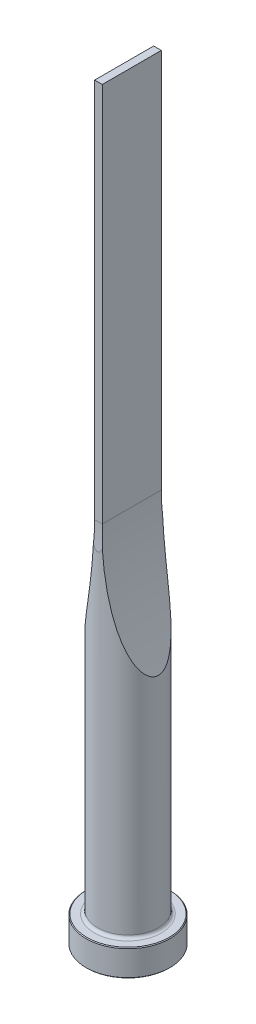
ISO-10303-21;
HEADER;
FILE_DESCRIPTION(('STEP AP214'),'2;1');
FILE_NAME('part.step','',(''),(''),'','','');
FILE_SCHEMA(('AUTOMOTIVE_DESIGN { 1 0 10303 214 1 1 1 1 }'));
ENDSEC;
DATA;
#1=APPLICATION_CONTEXT('core data for automotive mechanical design processes');
#2=APPLICATION_PROTOCOL_DEFINITION('international standard','automotive_design',2000,#1);
#3=PRODUCT_CONTEXT('',#1,'mechanical');
#4=PRODUCT('Part','Part','',(#3));
#5=PRODUCT_RELATED_PRODUCT_CATEGORY('part','',(#4));
#6=PRODUCT_DEFINITION_FORMATION('','',#4);
#7=PRODUCT_DEFINITION_CONTEXT('part definition',#1,'design');
#8=PRODUCT_DEFINITION('design','',#6,#7);
#9=PRODUCT_DEFINITION_SHAPE('','',#8);
#10=(LENGTH_UNIT() NAMED_UNIT(*) SI_UNIT(.MILLI.,.METRE.));
#11=(NAMED_UNIT(*) PLANE_ANGLE_UNIT() SI_UNIT($,.RADIAN.));
#12=(NAMED_UNIT(*) SI_UNIT($,.STERADIAN.) SOLID_ANGLE_UNIT());
#13=UNCERTAINTY_MEASURE_WITH_UNIT(LENGTH_MEASURE(1.E-05),#10,'distance_accuracy_value','');
#14=(GEOMETRIC_REPRESENTATION_CONTEXT(3) GLOBAL_UNCERTAINTY_ASSIGNED_CONTEXT((#13)) GLOBAL_UNIT_ASSIGNED_CONTEXT((#10,
#11,#12)) REPRESENTATION_CONTEXT('',''));
#15=CARTESIAN_POINT('',(0.,0.,0.));
#16=DIRECTION('',(0.,0.,1.));
#17=DIRECTION('',(1.,0.,0.));
#18=AXIS2_PLACEMENT_3D('',#15,#16,#17);
#19=CARTESIAN_POINT('',(0.,0.,0.));
#20=DIRECTION('',(0.,1.,0.));
#21=DIRECTION('',(-1.,0.,0.));
#22=AXIS2_PLACEMENT_3D('',#19,#20,#21);
#23=PLANE('',#22);
#24=CARTESIAN_POINT('',(0.,0.,0.));
#25=DIRECTION('',(0.,1.,0.));
#26=DIRECTION('',(-1.,0.,0.));
#27=AXIS2_PLACEMENT_3D('',#24,#25,#26);
#28=CIRCLE('',#27,10.8);
#29=CARTESIAN_POINT('',(-10.8,0.,0.));
#30=VERTEX_POINT('',#29);
#31=EDGE_CURVE('E133',#30,#30,#28,.T.);
#32=ORIENTED_EDGE('',*,*,#31,.F.);
#33=EDGE_LOOP('',(#32));
#34=FACE_BOUND('',#33,.T.);
#35=ADVANCED_FACE('F32',(#34),#23,.F.);
#36=CARTESIAN_POINT('',(0.,0.,0.));
#37=DIRECTION('',(0.,1.,0.));
#38=DIRECTION('',(-1.,0.,0.));
#39=AXIS2_PLACEMENT_3D('',#36,#37,#38);
#40=CONICAL_SURFACE('',#39,10.8,0.785398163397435);
#41=CARTESIAN_POINT('',(0.,0.200000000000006,0.));
#42=DIRECTION('',(0.,1.,0.));
#43=DIRECTION('',(-1.,0.,0.));
#44=AXIS2_PLACEMENT_3D('',#41,#42,#43);
#45=CIRCLE('',#44,11.);
#46=CARTESIAN_POINT('',(-11.,0.200000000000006,0.));
#47=VERTEX_POINT('',#46);
#48=EDGE_CURVE('E130',#47,#47,#45,.T.);
#49=ORIENTED_EDGE('',*,*,#48,.F.);
#50=EDGE_LOOP('',(#49));
#51=FACE_BOUND('',#50,.T.);
#52=ORIENTED_EDGE('',*,*,#31,.T.);
#53=EDGE_LOOP('',(#52));
#54=FACE_BOUND('',#53,.T.);
#55=ADVANCED_FACE('F171',(#51,#54),#40,.T.);
#56=CARTESIAN_POINT('',(0.,200.,0.));
#57=DIRECTION('',(0.,1.,0.));
#58=DIRECTION('',(-1.,0.,0.));
#59=AXIS2_PLACEMENT_3D('',#56,#57,#58);
#60=CYLINDRICAL_SURFACE('',#59,11.);
#61=CARTESIAN_POINT('',(0.,6.8,0.));
#62=DIRECTION('',(0.,1.,0.));
#63=DIRECTION('',(-1.,0.,0.));
#64=AXIS2_PLACEMENT_3D('',#61,#62,#63);
#65=CIRCLE('',#64,11.);
#66=CARTESIAN_POINT('',(-11.,6.8,0.));
#67=VERTEX_POINT('',#66);
#68=EDGE_CURVE('E127',#67,#67,#65,.T.);
#69=ORIENTED_EDGE('',*,*,#68,.F.);
#70=EDGE_LOOP('',(#69));
#71=FACE_BOUND('',#70,.T.);
#72=ORIENTED_EDGE('',*,*,#48,.T.);
#73=EDGE_LOOP('',(#72));
#74=FACE_BOUND('',#73,.T.);
#75=ADVANCED_FACE('F176',(#71,#74),#60,.T.);
#76=CARTESIAN_POINT('',(0.,6.8,0.));
#77=DIRECTION('',(0.,-1.,0.));
#78=DIRECTION('',(1.,0.,0.));
#79=AXIS2_PLACEMENT_3D('',#76,#77,#78);
#80=CONICAL_SURFACE('',#79,11.,0.78539816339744);
#81=CARTESIAN_POINT('',(0.,7.00000000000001,0.));
#82=DIRECTION('',(0.,1.,0.));
#83=DIRECTION('',(-1.,0.,0.));
#84=AXIS2_PLACEMENT_3D('',#81,#82,#83);
#85=CIRCLE('',#84,10.8);
#86=CARTESIAN_POINT('',(-10.8,7.00000000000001,0.));
#87=VERTEX_POINT('',#86);
#88=EDGE_CURVE('E124',#87,#87,#85,.T.);
#89=ORIENTED_EDGE('',*,*,#88,.F.);
#90=EDGE_LOOP('',(#89));
#91=FACE_BOUND('',#90,.T.);
#92=ORIENTED_EDGE('',*,*,#68,.T.);
#93=EDGE_LOOP('',(#92));
#94=FACE_BOUND('',#93,.T.);
#95=ADVANCED_FACE('F183',(#91,#94),#80,.T.);
#96=CARTESIAN_POINT('',(10.8,7.,0.));
#97=DIRECTION('',(0.,-1.,0.));
#98=DIRECTION('',(1.,0.,0.));
#99=AXIS2_PLACEMENT_3D('',#96,#97,#98);
#100=PLANE('',#99);
#101=CARTESIAN_POINT('',(0.,7.00000000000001,0.));
#102=DIRECTION('',(0.,1.,0.));
#103=DIRECTION('',(-1.,0.,0.));
#104=AXIS2_PLACEMENT_3D('',#101,#102,#103);
#105=CIRCLE('',#104,8.80000000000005);
#106=CARTESIAN_POINT('',(-8.80000000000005,7.00000000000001,0.));
#107=VERTEX_POINT('',#106);
#108=EDGE_CURVE('E121',#107,#107,#105,.T.);
#109=ORIENTED_EDGE('',*,*,#108,.F.);
#110=EDGE_LOOP('',(#109));
#111=FACE_BOUND('',#110,.T.);
#112=ORIENTED_EDGE('',*,*,#88,.T.);
#113=EDGE_LOOP('',(#112));
#114=FACE_BOUND('',#113,.T.);
#115=ADVANCED_FACE('F190',(#111,#114),#100,.F.);
#116=CARTESIAN_POINT('',(0.,7.8,0.));
#117=DIRECTION('',(0.,1.,0.));
#118=DIRECTION('',(-1.,0.,0.));
#119=AXIS2_PLACEMENT_3D('',#116,#117,#118);
#120=TOROIDAL_SURFACE('',#119,8.80000000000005,0.8);
#121=CARTESIAN_POINT('',(0.,7.8,0.));
#122=DIRECTION('',(0.,1.,0.));
#123=DIRECTION('',(-1.,0.,0.));
#124=AXIS2_PLACEMENT_3D('',#121,#122,#123);
#125=CIRCLE('',#124,8.00000000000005);
#126=CARTESIAN_POINT('',(-8.00000000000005,7.8,0.));
#127=VERTEX_POINT('',#126);
#128=EDGE_CURVE('E112',#127,#127,#125,.T.);
#129=ORIENTED_EDGE('',*,*,#128,.F.);
#130=EDGE_LOOP('',(#129));
#131=FACE_BOUND('',#130,.T.);
#132=ORIENTED_EDGE('',*,*,#108,.T.);
#133=EDGE_LOOP('',(#132));
#134=FACE_BOUND('',#133,.T.);
#135=ADVANCED_FACE('F168',(#131,#134),#120,.F.);
#136=CARTESIAN_POINT('',(0.,200.,0.));
#137=DIRECTION('',(0.,1.,0.));
#138=DIRECTION('',(-1.,0.,0.));
#139=AXIS2_PLACEMENT_3D('',#136,#137,#138);
#140=CYLINDRICAL_SURFACE('',#139,8.00000000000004);
#141=CARTESIAN_POINT('',(8.00000000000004,65.2005747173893,0.));
#142=CARTESIAN_POINT('',(7.99999968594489,65.2005754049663,0.0951898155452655));
#143=CARTESIAN_POINT('',(7.99829512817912,65.2046400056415,0.190388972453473));
#144=CARTESIAN_POINT('',(7.99153454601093,65.2207716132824,0.380003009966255));
#145=CARTESIAN_POINT('',(7.98647695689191,65.2328423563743,0.474417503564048));
#146=CARTESIAN_POINT('',(7.96644485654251,65.2806970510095,0.75562565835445));
#147=CARTESIAN_POINT('',(7.9466114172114,65.3281225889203,0.940195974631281));
#148=CARTESIAN_POINT('',(7.89043863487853,65.4629601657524,1.33784788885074));
#149=CARTESIAN_POINT('',(7.85143072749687,65.5568669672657,1.54828766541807));
#150=CARTESIAN_POINT('',(7.76144530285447,65.7749091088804,1.95001230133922));
#151=CARTESIAN_POINT('',(7.71044783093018,65.8990948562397,2.1412644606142));
#152=CARTESIAN_POINT('',(7.61166213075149,66.1414918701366,2.46682573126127));
#153=CARTESIAN_POINT('',(7.56539596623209,66.2556156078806,2.60472561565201));
#154=CARTESIAN_POINT('',(7.46905337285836,66.4948127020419,2.86933440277));
#155=CARTESIAN_POINT('',(7.41897455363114,66.6198929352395,2.99603617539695));
#156=CARTESIAN_POINT('',(7.31603232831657,66.8788132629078,3.23931243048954));
#157=CARTESIAN_POINT('',(7.26316442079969,67.0126676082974,3.35586968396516));
#158=CARTESIAN_POINT('',(7.15551047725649,67.2872602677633,3.57967746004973));
#159=CARTESIAN_POINT('',(7.10072369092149,67.4280012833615,3.68692428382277));
#160=CARTESIAN_POINT('',(6.99000672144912,67.7146384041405,3.89274038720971));
#161=CARTESIAN_POINT('',(6.9340797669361,67.8605206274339,3.99133084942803));
#162=CARTESIAN_POINT('',(6.8214022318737,68.15680857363,4.18098308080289));
#163=CARTESIAN_POINT('',(6.76465148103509,68.3072152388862,4.27204326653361));
#164=CARTESIAN_POINT('',(6.5936435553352,68.7642409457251,4.53517276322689));
#165=CARTESIAN_POINT('',(6.47870157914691,69.0764826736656,4.69706305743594));
#166=CARTESIAN_POINT('',(6.24883926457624,69.7121248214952,4.99879708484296));
#167=CARTESIAN_POINT('',(6.13391945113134,70.0355467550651,5.13859505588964));
#168=CARTESIAN_POINT('',(5.96268993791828,70.5265207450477,5.33420973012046));
#169=CARTESIAN_POINT('',(5.90581545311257,70.6911215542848,5.39705734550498));
#170=CARTESIAN_POINT('',(5.79254575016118,71.0220718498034,5.51845204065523));
#171=CARTESIAN_POINT('',(5.73615054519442,71.1884213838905,5.57699900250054));
#172=CARTESIAN_POINT('',(5.59290285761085,71.6150972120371,5.72143005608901));
#173=CARTESIAN_POINT('',(5.50645869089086,71.876507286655,5.80452149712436));
#174=CARTESIAN_POINT('',(5.33524655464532,72.402418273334,5.9622719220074));
#175=CARTESIAN_POINT('',(5.25047876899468,72.6669195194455,6.03692998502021));
#176=CARTESIAN_POINT('',(5.08280932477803,73.1986180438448,6.17876308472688));
#177=CARTESIAN_POINT('',(4.99990838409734,73.4658163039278,6.24593528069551));
#178=CARTESIAN_POINT('',(4.8361680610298,74.0024463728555,6.3735575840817));
#179=CARTESIAN_POINT('',(4.75532879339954,74.2718783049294,6.43400731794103));
#180=CARTESIAN_POINT('',(4.51582379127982,75.0840190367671,6.60652825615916));
#181=CARTESIAN_POINT('',(4.36046377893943,75.6296448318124,6.7095292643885));
#182=CARTESIAN_POINT('',(4.0593506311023,76.7266864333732,6.89586397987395));
#183=CARTESIAN_POINT('',(3.9135958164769,77.2781012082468,6.97920113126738));
#184=CARTESIAN_POINT('',(3.63139933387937,78.3884882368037,7.13012375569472));
#185=CARTESIAN_POINT('',(3.49500918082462,78.9474847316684,7.19762637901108));
#186=CARTESIAN_POINT('',(3.23268287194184,80.0693715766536,7.31919695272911));
#187=CARTESIAN_POINT('',(3.10674701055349,80.6322620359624,7.37326452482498));
#188=CARTESIAN_POINT('',(2.86565816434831,81.7607457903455,7.47026525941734));
#189=CARTESIAN_POINT('',(2.75049540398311,82.3263361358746,7.51320857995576));
#190=CARTESIAN_POINT('',(2.53096880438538,83.4602292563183,7.58997438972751));
#191=CARTESIAN_POINT('',(2.42660522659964,84.0285320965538,7.6237966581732));
#192=CARTESIAN_POINT('',(2.22464626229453,85.1912472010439,7.68521631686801));
#193=CARTESIAN_POINT('',(2.12751672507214,85.7857570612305,7.71249406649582));
#194=CARTESIAN_POINT('',(1.94517731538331,86.9768826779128,7.76048765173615));
#195=CARTESIAN_POINT('',(1.85996788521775,87.5734985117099,7.78120324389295));
#196=CARTESIAN_POINT('',(1.70152266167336,88.7685568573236,7.81737954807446));
#197=CARTESIAN_POINT('',(1.62828851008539,89.3669996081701,7.83283953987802));
#198=CARTESIAN_POINT('',(1.4938521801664,90.5653286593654,7.85958657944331));
#199=CARTESIAN_POINT('',(1.43265005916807,91.1652149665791,7.87087360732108));
#200=CARTESIAN_POINT('',(1.32225717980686,92.3667334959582,7.89016969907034));
#201=CARTESIAN_POINT('',(1.27307820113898,92.968366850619,7.89817555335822));
#202=CARTESIAN_POINT('',(1.18683300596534,94.1725306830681,7.91159474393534));
#203=CARTESIAN_POINT('',(1.14976682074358,94.7750611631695,7.91700807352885));
#204=CARTESIAN_POINT('',(1.08776652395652,95.9807199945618,7.9257645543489));
#205=CARTESIAN_POINT('',(1.06283159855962,96.5838483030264,7.9291078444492));
#206=CARTESIAN_POINT('',(1.02510116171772,97.7904907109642,7.93407395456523));
#207=CARTESIAN_POINT('',(1.01230563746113,98.3940048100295,7.9356967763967));
#208=CARTESIAN_POINT('',(0.998864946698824,99.6006808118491,7.93739973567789));
#209=CARTESIAN_POINT('',(0.998209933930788,100.203842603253,7.937481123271));
#210=CARTESIAN_POINT('',(1.00902540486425,101.410056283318,7.93611350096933));
#211=CARTESIAN_POINT('',(1.02049589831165,102.013108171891,7.93466448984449));
#212=CARTESIAN_POINT('',(1.05555842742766,103.218886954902,7.93007624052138));
#213=CARTESIAN_POINT('',(1.07915113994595,103.821613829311,7.92693690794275));
#214=CARTESIAN_POINT('',(1.1384480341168,105.026456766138,7.91863830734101));
#215=CARTESIAN_POINT('',(1.17415218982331,105.628572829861,7.91347904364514));
#216=CARTESIAN_POINT('',(1.2576196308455,106.831420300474,7.90064394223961));
#217=CARTESIAN_POINT('',(1.30537248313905,107.432152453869,7.89297028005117));
#218=CARTESIAN_POINT('',(1.41292919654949,108.632487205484,7.87442760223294));
#219=CARTESIAN_POINT('',(1.47273302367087,109.232089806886,7.8635585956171));
#220=CARTESIAN_POINT('',(1.60435274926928,110.429821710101,7.83776437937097));
#221=CARTESIAN_POINT('',(1.67616729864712,111.027951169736,7.82283962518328));
#222=CARTESIAN_POINT('',(1.83176793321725,112.222485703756,7.78787433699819));
#223=CARTESIAN_POINT('',(1.91555365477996,112.818890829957,7.76783395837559));
#224=CARTESIAN_POINT('',(2.09527994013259,114.011253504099,7.72129816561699));
#225=CARTESIAN_POINT('',(2.19125242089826,114.607205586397,7.69478562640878));
#226=CARTESIAN_POINT('',(2.39509132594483,115.796652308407,7.63379718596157));
#227=CARTESIAN_POINT('',(2.50295739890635,116.390147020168,7.59932151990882));
#228=CARTESIAN_POINT('',(2.73054263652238,117.574606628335,7.52054876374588));
#229=CARTESIAN_POINT('',(2.85026925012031,118.165569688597,7.47624547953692));
#230=CARTESIAN_POINT('',(3.10135018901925,119.343998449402,7.37563070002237));
#231=CARTESIAN_POINT('',(3.23270432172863,119.931464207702,7.31931940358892));
#232=CARTESIAN_POINT('',(3.50633260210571,121.100167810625,7.1922408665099));
#233=CARTESIAN_POINT('',(3.64856803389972,121.681420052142,7.12152351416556));
#234=CARTESIAN_POINT('',(3.94400085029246,122.838777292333,6.96225785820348));
#235=CARTESIAN_POINT('',(4.09719959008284,123.414881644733,6.87370734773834));
#236=CARTESIAN_POINT('',(4.4137915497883,124.559734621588,6.67483610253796));
#237=CARTESIAN_POINT('',(4.57717072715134,125.128492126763,6.56454492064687));
#238=CARTESIAN_POINT('',(4.82930445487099,125.974949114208,6.37876498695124));
#239=CARTESIAN_POINT('',(4.914516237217,126.255956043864,6.31345656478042));
#240=CARTESIAN_POINT('',(5.08713730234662,126.815399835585,6.17521536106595));
#241=CARTESIAN_POINT('',(5.17454640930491,127.093836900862,6.10228318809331));
#242=CARTESIAN_POINT('',(5.32140384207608,127.55385844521,5.97400009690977));
#243=CARTESIAN_POINT('',(5.38029215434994,127.736296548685,5.92106403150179));
#244=CARTESIAN_POINT('',(5.49886094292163,128.099675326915,5.81111513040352));
#245=CARTESIAN_POINT('',(5.55854140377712,128.28061603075,5.75410237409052));
#246=CARTESIAN_POINT('',(5.73867731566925,128.821016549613,5.57638921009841));
#247=CARTESIAN_POINT('',(5.86020024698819,129.177970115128,5.44903714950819));
#248=CARTESIAN_POINT('',(6.10470062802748,129.881872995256,5.17363421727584));
#249=CARTESIAN_POINT('',(6.22767165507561,130.228852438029,5.02565587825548));
#250=CARTESIAN_POINT('',(6.41230815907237,130.740125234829,4.78460865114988));
#251=CARTESIAN_POINT('',(6.47387012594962,130.908980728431,4.70110003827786));
#252=CARTESIAN_POINT('',(6.59678680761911,131.243067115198,4.52700525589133));
#253=CARTESIAN_POINT('',(6.65814155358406,131.408298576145,4.43642020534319));
#254=CARTESIAN_POINT('',(6.77281683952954,131.714428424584,4.25895492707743));
#255=CARTESIAN_POINT('',(6.8262005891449,131.855827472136,4.17298092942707));
#256=CARTESIAN_POINT('',(6.93224266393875,132.134629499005,3.9943466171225));
#257=CARTESIAN_POINT('',(6.9849010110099,132.272032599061,3.90168650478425));
#258=CARTESIAN_POINT('',(7.08925706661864,132.542407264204,3.7087060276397));
#259=CARTESIAN_POINT('',(7.14095162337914,132.675365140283,3.60836466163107));
#260=CARTESIAN_POINT('',(7.2427190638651,132.935351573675,3.39948932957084));
#261=CARTESIAN_POINT('',(7.29279197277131,133.062380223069,3.29095549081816));
#262=CARTESIAN_POINT('',(7.39144636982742,133.311077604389,3.06303123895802));
#263=CARTESIAN_POINT('',(7.43999201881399,133.432630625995,2.94349693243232));
#264=CARTESIAN_POINT('',(7.53381793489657,133.666190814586,2.694323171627));
#265=CARTESIAN_POINT('',(7.57909710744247,133.778194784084,2.56468036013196));
#266=CARTESIAN_POINT('',(7.70793180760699,134.095197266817,2.16037788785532));
#267=CARTESIAN_POINT('',(7.78519729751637,134.282972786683,1.86879216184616));
#268=CARTESIAN_POINT('',(7.88033493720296,134.512738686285,1.38899625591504));
#269=CARTESIAN_POINT('',(7.90910974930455,134.58189769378,1.21587879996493));
#270=CARTESIAN_POINT('',(7.95568575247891,134.693594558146,0.859756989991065));
#271=CARTESIAN_POINT('',(7.97349730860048,134.736157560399,0.676762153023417));
#272=CARTESIAN_POINT('',(7.99640047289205,134.790852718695,0.304240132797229));
#273=CARTESIAN_POINT('',(8.00141393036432,134.802797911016,0.114679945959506));
#274=CARTESIAN_POINT('',(7.99789292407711,134.794399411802,-0.263610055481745));
#275=CARTESIAN_POINT('',(7.98935682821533,134.774051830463,-0.452339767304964));
#276=CARTESIAN_POINT('',(7.96081303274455,134.705829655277,-0.809502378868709));
#277=CARTESIAN_POINT('',(7.94167563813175,134.660042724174,-0.978418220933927));
#278=CARTESIAN_POINT('',(7.89424584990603,134.546163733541,-1.30709937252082));
#279=CARTESIAN_POINT('',(7.86594930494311,134.478061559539,-1.46686049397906));
#280=CARTESIAN_POINT('',(7.78372128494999,134.27926575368,-1.86420721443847));
#281=CARTESIAN_POINT('',(7.72439416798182,134.135073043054,-2.09389183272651));
#282=CARTESIAN_POINT('',(7.59397693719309,133.815163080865,-2.52644457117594));
#283=CARTESIAN_POINT('',(7.52285251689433,133.639353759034,-2.72923128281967));
#284=CARTESIAN_POINT('',(7.38255555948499,133.28895057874,-3.08707888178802));
#285=CARTESIAN_POINT('',(7.31420744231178,133.116835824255,-3.24494358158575));
#286=CARTESIAN_POINT('',(7.1739325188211,132.760146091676,-3.54429794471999));
#287=CARTESIAN_POINT('',(7.10200284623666,132.575561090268,-3.68577418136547));
#288=CARTESIAN_POINT('',(6.95590090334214,132.196750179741,-3.95460160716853));
#289=CARTESIAN_POINT('',(6.88172471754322,132.002507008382,-4.0819260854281));
#290=CARTESIAN_POINT('',(6.73227144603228,131.606876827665,-4.32397115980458));
#291=CARTESIAN_POINT('',(6.65699468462,131.405491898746,-4.43869538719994));
#292=CARTESIAN_POINT('',(6.47952844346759,130.925334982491,-4.69552369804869));
#293=CARTESIAN_POINT('',(6.37716733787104,130.644212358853,-4.83310281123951));
#294=CARTESIAN_POINT('',(6.17288514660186,130.074115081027,-5.09142149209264));
#295=CARTESIAN_POINT('',(6.070964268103,129.785137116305,-5.21215382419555));
#296=CARTESIAN_POINT('',(5.86824674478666,129.200692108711,-5.4393831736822));
#297=CARTESIAN_POINT('',(5.76745219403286,128.905215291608,-5.54585675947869));
#298=CARTESIAN_POINT('',(5.5677451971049,128.309513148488,-5.74632195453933));
#299=CARTESIAN_POINT('',(5.46883248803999,128.009288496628,-5.84031531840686));
#300=CARTESIAN_POINT('',(5.27282470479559,127.403526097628,-6.0178802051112));
#301=CARTESIAN_POINT('',(5.17574034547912,127.097970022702,-6.1014007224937));
#302=CARTESIAN_POINT('',(4.98417270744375,126.483598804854,-6.25886492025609));
#303=CARTESIAN_POINT('',(4.88968948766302,126.174783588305,-6.33280838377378));
#304=CARTESIAN_POINT('',(4.70363882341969,125.554700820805,-6.47219266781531));
#305=CARTESIAN_POINT('',(4.61206878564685,125.243435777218,-6.53764122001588));
#306=CARTESIAN_POINT('',(4.43192525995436,124.618573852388,-6.66107734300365));
#307=CARTESIAN_POINT('',(4.34335180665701,124.304976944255,-6.71906482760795));
#308=CARTESIAN_POINT('',(4.12841382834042,123.527809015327,-6.85412728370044));
#309=CARTESIAN_POINT('',(4.00386624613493,123.063064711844,-6.92735391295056));
#310=CARTESIAN_POINT('',(3.76184032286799,122.129976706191,-7.06170615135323));
#311=CARTESIAN_POINT('',(3.6443626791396,121.661632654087,-7.12283056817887));
#312=CARTESIAN_POINT('',(3.41666459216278,120.721805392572,-7.23481178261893));
#313=CARTESIAN_POINT('',(3.30644657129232,120.250321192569,-7.28566516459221));
#314=CARTESIAN_POINT('',(3.09346099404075,119.30479904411,-7.37861740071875));
#315=CARTESIAN_POINT('',(2.99069379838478,118.830760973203,-7.42071583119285));
#316=CARTESIAN_POINT('',(2.79255626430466,117.87968770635,-7.49752866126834));
#317=CARTESIAN_POINT('',(2.69719907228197,117.402648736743,-7.53223011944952));
#318=CARTESIAN_POINT('',(2.51416019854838,116.446671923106,-7.59528568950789));
#319=CARTESIAN_POINT('',(2.42647875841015,115.967734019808,-7.62363960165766));
#320=CARTESIAN_POINT('',(2.25887310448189,115.008314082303,-7.67497072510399));
#321=CARTESIAN_POINT('',(2.17894737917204,114.527832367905,-7.6979489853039));
#322=CARTESIAN_POINT('',(2.02687944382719,113.565440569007,-7.73937658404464));
#323=CARTESIAN_POINT('',(1.95473741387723,113.083530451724,-7.75782581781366));
#324=CARTESIAN_POINT('',(1.74970689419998,111.63355929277,-7.80759135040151));
#325=CARTESIAN_POINT('',(1.62862431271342,110.663605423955,-7.83320749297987));
#326=CARTESIAN_POINT('',(1.4181039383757,108.720061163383,-7.87403437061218));
#327=CARTESIAN_POINT('',(1.32866717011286,107.746470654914,-7.8892447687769));
#328=CARTESIAN_POINT('',(1.18163064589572,105.797783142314,-7.91260337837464));
#329=CARTESIAN_POINT('',(1.12399909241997,104.82268862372,-7.92075864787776));
#330=CARTESIAN_POINT('',(1.0405060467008,102.871126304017,-7.93215646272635));
#331=CARTESIAN_POINT('',(1.01464433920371,101.894658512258,-7.93539904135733));
#332=CARTESIAN_POINT('',(0.993960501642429,99.8669331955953,-7.93802255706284));
#333=CARTESIAN_POINT('',(1.00165471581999,98.8156485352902,-7.93709028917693));
#334=CARTESIAN_POINT('',(1.05386528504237,96.7139915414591,-7.93032404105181));
#335=CARTESIAN_POINT('',(1.09838262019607,95.6636192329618,-7.9244899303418));
#336=CARTESIAN_POINT('',(1.22425539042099,93.563934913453,-7.90602973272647));
#337=CARTESIAN_POINT('',(1.30565178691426,92.5146253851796,-7.89339609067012));
#338=CARTESIAN_POINT('',(1.45528326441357,90.943481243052,-7.86667893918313));
#339=CARTESIAN_POINT('',(1.5097501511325,90.4202346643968,-7.85647872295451));
#340=CARTESIAN_POINT('',(1.62784054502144,89.3748516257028,-7.83286557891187));
#341=CARTESIAN_POINT('',(1.69146386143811,88.8527151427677,-7.81945271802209));
#342=CARTESIAN_POINT('',(1.82736746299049,87.8133515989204,-7.78880876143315));
#343=CARTESIAN_POINT('',(1.89958495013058,87.2961155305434,-7.77160466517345));
#344=CARTESIAN_POINT('',(2.052982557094,86.2631624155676,-7.73249834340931));
#345=CARTESIAN_POINT('',(2.13416245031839,85.7474453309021,-7.71059623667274));
#346=CARTESIAN_POINT('',(2.30545556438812,84.7176473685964,-7.66112428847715));
#347=CARTESIAN_POINT('',(2.39557077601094,84.2035668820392,-7.63355318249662));
#348=CARTESIAN_POINT('',(2.58465162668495,83.1774457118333,-7.57162306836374));
#349=CARTESIAN_POINT('',(2.68361718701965,82.6654050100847,-7.5372641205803));
#350=CARTESIAN_POINT('',(2.89011341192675,81.6446599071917,-7.46051995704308));
#351=CARTESIAN_POINT('',(2.99762759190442,81.1359510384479,-7.4181499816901));
#352=CARTESIAN_POINT('',(3.22126242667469,80.1212899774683,-7.32381077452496));
#353=CARTESIAN_POINT('',(3.33738341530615,79.6153378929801,-7.27184117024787));
#354=CARTESIAN_POINT('',(3.57799451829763,78.6069752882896,-7.15651798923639));
#355=CARTESIAN_POINT('',(3.70248069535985,78.1045632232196,-7.0931697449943));
#356=CARTESIAN_POINT('',(3.95961162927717,77.1037640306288,-6.95290946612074));
#357=CARTESIAN_POINT('',(4.09225533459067,76.6053763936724,-6.87599917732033));
#358=CARTESIAN_POINT('',(4.27445498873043,75.9436192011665,-6.7625374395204));
#359=CARTESIAN_POINT('',(4.32055424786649,75.778043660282,-6.73319330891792));
#360=CARTESIAN_POINT('',(4.41360552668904,75.4474895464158,-6.67256862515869));
#361=CARTESIAN_POINT('',(4.46055753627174,75.2825109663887,-6.64128809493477));
#362=CARTESIAN_POINT('',(4.6026689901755,74.788522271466,-6.54435661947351));
#363=CARTESIAN_POINT('',(4.69908104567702,74.4604694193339,-6.47561752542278));
#364=CARTESIAN_POINT('',(4.89528849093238,73.8065760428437,-6.32860339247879));
#365=CARTESIAN_POINT('',(4.99509178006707,73.4807431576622,-6.25030480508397));
#366=CARTESIAN_POINT('',(5.1975768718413,72.8327511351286,-6.08296344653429));
#367=CARTESIAN_POINT('',(5.30025857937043,72.510591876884,-5.99392103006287));
#368=CARTESIAN_POINT('',(5.52510687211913,71.8185227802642,-5.78792965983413));
#369=CARTESIAN_POINT('',(5.64771898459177,71.449398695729,-5.66879789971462));
#370=CARTESIAN_POINT('',(5.89557187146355,70.7188599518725,-5.4105719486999));
#371=CARTESIAN_POINT('',(6.02081370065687,70.3574485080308,-5.27146961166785));
#372=CARTESIAN_POINT('',(6.2721779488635,69.6464572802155,-4.96973910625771));
#373=CARTESIAN_POINT('',(6.39829525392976,69.2968379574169,-4.80720179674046));
#374=CARTESIAN_POINT('',(6.58685583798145,68.7837478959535,-4.5414791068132));
#375=CARTESIAN_POINT('',(6.6495844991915,68.6146660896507,-4.449288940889));
#376=CARTESIAN_POINT('',(6.77447567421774,68.2810352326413,-4.25672096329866));
#377=CARTESIAN_POINT('',(6.83663831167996,68.1164851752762,-4.15634498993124));
#378=CARTESIAN_POINT('',(6.94405120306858,67.8345838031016,-3.97345109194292));
#379=CARTESIAN_POINT('',(6.98953447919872,67.7159898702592,-3.89299059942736));
#380=CARTESIAN_POINT('',(7.07966167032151,67.4824274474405,-3.7265710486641));
#381=CARTESIAN_POINT('',(7.12430560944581,67.3674588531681,-3.640612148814));
#382=CARTESIAN_POINT('',(7.25670307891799,67.028515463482,-3.37342059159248));
#383=CARTESIAN_POINT('',(7.34280651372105,66.8108061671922,-3.18306526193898));
#384=CARTESIAN_POINT('',(7.46632416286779,66.5016770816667,-2.87512473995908));
#385=CARTESIAN_POINT('',(7.50678239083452,66.4009897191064,-2.76803236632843));
#386=CARTESIAN_POINT('',(7.5849397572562,66.2074174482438,-2.54609245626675));
#387=CARTESIAN_POINT('',(7.62263834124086,66.114534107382,-2.43124337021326));
#388=CARTESIAN_POINT('',(7.73022265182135,65.8506243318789,-2.07483501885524));
#389=CARTESIAN_POINT('',(7.79494270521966,65.6934768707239,-1.82059217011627));
#390=CARTESIAN_POINT('',(7.88178671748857,65.4837645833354,-1.38106361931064));
#391=CARTESIAN_POINT('',(7.91080089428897,65.414040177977,-1.20529404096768));
#392=CARTESIAN_POINT('',(7.95743556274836,65.3022161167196,-0.84386998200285));
#393=CARTESIAN_POINT('',(7.97508793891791,65.2600391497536,-0.658244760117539));
#394=CARTESIAN_POINT('',(7.99075240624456,65.2226377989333,-0.392445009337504));
#395=CARTESIAN_POINT('',(7.99421164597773,65.2143833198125,-0.314251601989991));
#396=CARTESIAN_POINT('',(7.99883587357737,65.2033507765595,-0.157374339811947));
#397=CARTESIAN_POINT('',(8.00000025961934,65.2005741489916,-0.0786903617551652));
#398=CARTESIAN_POINT('',(8.00000000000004,65.2005747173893,0.));
#399=B_SPLINE_CURVE_WITH_KNOTS('',3,(#141,#142,#143,#144,#145,#146,#147,#148,#149,#150,#151,
#152,#153,#154,#155,#156,#157,#158,#159,#160,#161,#162,#163,#164,#165,#166,#167,#168,#169,#170,
#171,#172,#173,#174,#175,#176,#177,#178,#179,#180,#181,#182,#183,#184,#185,#186,#187,#188,#189,
#190,#191,#192,#193,#194,#195,#196,#197,#198,#199,#200,#201,#202,#203,#204,#205,#206,#207,#208,
#209,#210,#211,#212,#213,#214,#215,#216,#217,#218,#219,#220,#221,#222,#223,#224,#225,#226,#227,
#228,#229,#230,#231,#232,#233,#234,#235,#236,#237,#238,#239,#240,#241,#242,#243,#244,#245,#246,
#247,#248,#249,#250,#251,#252,#253,#254,#255,#256,#257,#258,#259,#260,#261,#262,#263,#264,#265,
#266,#267,#268,#269,#270,#271,#272,#273,#274,#275,#276,#277,#278,#279,#280,#281,#282,#283,#284,
#285,#286,#287,#288,#289,#290,#291,#292,#293,#294,#295,#296,#297,#298,#299,#300,#301,#302,#303,
#304,#305,#306,#307,#308,#309,#310,#311,#312,#313,#314,#315,#316,#317,#318,#319,#320,#321,#322,
#323,#324,#325,#326,#327,#328,#329,#330,#331,#332,#333,#334,#335,#336,#337,#338,#339,#340,#341,
#342,#343,#344,#345,#346,#347,#348,#349,#350,#351,#352,#353,#354,#355,#356,#357,#358,#359,#360,
#361,#362,#363,#364,#365,#366,#367,#368,#369,#370,#371,#372,#373,#374,#375,#376,#377,#378,#379,
#380,#381,#382,#383,#384,#385,#386,#387,#388,#389,#390,#391,#392,#393,#394,#395,#396,#397,#398),
.UNSPECIFIED.,.T.,.F.,(4,2,2,2,2,2,2,2,2,2,2,2,2,2,2,2,2,2,2,2,2,2,2,2,2,2,2,2,2,2,2,2,2,2,2,2,
2,2,2,2,2,2,2,2,2,2,2,2,2,2,2,2,2,2,2,2,2,2,2,2,2,2,2,2,2,2,2,2,2,2,2,2,2,2,2,2,2,2,2,2,2,2,2,2,
2,2,2,2,2,2,2,2,2,2,2,2,2,2,2,2,2,2,2,2,2,2,2,2,2,2,2,2,2,2,2,2,2,2,2,2,2,2,2,2,2,2,2,2,4),(0.,
0.285476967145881,0.571087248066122,1.14286351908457,1.84022525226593,2.53875595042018,
3.09264451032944,3.64688324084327,4.20204560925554,4.75742753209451,5.31141014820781,
5.86550895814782,6.97440699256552,8.08557271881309,8.64095204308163,9.19634658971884,
10.0589618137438,10.9216711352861,11.7847067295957,12.6477902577,14.3769622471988,
16.1058311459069,17.8435535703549,19.5813249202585,21.3175037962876,23.0537246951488,
24.8625858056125,26.6715140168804,28.4806900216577,30.2898746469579,32.1008247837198,
33.9117795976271,35.722612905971,37.5334443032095,39.3428070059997,41.1521711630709,
42.9616363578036,44.7710976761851,46.5789975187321,48.3868922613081,50.1945840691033,
52.0022209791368,53.8146936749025,55.6271128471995,57.4406776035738,59.2542123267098,
61.0615703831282,62.8691522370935,64.674293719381,65.5766552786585,66.4789448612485,
67.0755435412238,67.6721306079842,68.8655800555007,70.0549339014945,70.6493500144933,
71.2436723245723,71.765166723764,72.2866453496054,72.8096044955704,73.3325555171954,
73.863730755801,74.3950831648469,75.4504562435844,76.0143632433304,76.5777362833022,
77.1445413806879,77.7114147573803,78.2374688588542,78.7637617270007,79.5918212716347,
80.4223324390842,81.1513093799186,81.8808793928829,82.6118038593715,83.3425171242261,
84.3297266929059,85.3173589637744,86.3065948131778,87.2956914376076,88.2894321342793,
89.2831953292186,90.2760476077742,91.2689113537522,92.7287019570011,94.1886363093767,
95.6490553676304,97.1095450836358,98.5725694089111,100.035639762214,101.498424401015,
102.961242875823,105.894034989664,108.826922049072,111.75687159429,114.686801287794,
117.840072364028,120.99342737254,124.150293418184,125.728737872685,127.307149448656,
128.874664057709,130.442139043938,132.009964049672,133.577775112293,135.142633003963,
136.707551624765,138.271738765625,139.835724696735,140.358794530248,140.881858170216,
141.92801765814,142.976808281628,144.025564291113,145.245444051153,146.465822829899,
147.681591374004,148.289041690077,148.89635596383,149.347280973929,149.798192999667,
150.701144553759,151.158134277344,151.615215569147,152.525694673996,153.097588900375,
153.667871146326,153.903803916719,154.139798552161),.UNSPECIFIED.);
#400=CARTESIAN_POINT('',(1.16475494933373,94.5567705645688,-7.91475494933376));
#401=VERTEX_POINT('',#400);
#402=CARTESIAN_POINT('',(1.16475494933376,94.5567705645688,7.91475494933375));
#403=VERTEX_POINT('',#402);
#404=EDGE_CURVE('E138',#401,#403,#399,.T.);
#405=ORIENTED_EDGE('',*,*,#404,.T.);
#406=CARTESIAN_POINT('',(-1.98431348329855,100.,7.75000000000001));
#407=CARTESIAN_POINT('',(-1.98431671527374,100.310227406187,7.75000012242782));
#408=CARTESIAN_POINT('',(-1.97807758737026,100.620470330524,7.75160504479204));
#409=CARTESIAN_POINT('',(-1.95278869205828,101.240402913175,7.75801423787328));
#410=CARTESIAN_POINT('',(-1.93373880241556,101.550092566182,7.76281853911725));
#411=CARTESIAN_POINT('',(-1.88170740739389,102.168545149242,7.77559741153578));
#412=CARTESIAN_POINT('',(-1.84871351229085,102.477307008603,7.78357480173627));
#413=CARTESIAN_POINT('',(-1.76661059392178,103.092457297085,7.80261881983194));
#414=CARTESIAN_POINT('',(-1.71750945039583,103.398846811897,7.81368393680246));
#415=CARTESIAN_POINT('',(-1.59923669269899,104.00782620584,7.83876619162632));
#416=CARTESIAN_POINT('',(-1.53006503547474,104.310416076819,7.85278333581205));
#417=CARTESIAN_POINT('',(-1.40509547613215,104.758317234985,7.87574985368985));
#418=CARTESIAN_POINT('',(-1.35990520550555,104.906616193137,7.88372857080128));
#419=CARTESIAN_POINT('',(-1.26052233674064,105.200044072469,7.90023035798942));
#420=CARTESIAN_POINT('',(-1.2063365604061,105.34517530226,7.90875301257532));
#421=CARTESIAN_POINT('',(-1.08563979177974,105.631320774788,7.92623499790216));
#422=CARTESIAN_POINT('',(-1.0190668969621,105.772310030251,7.9351963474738));
#423=CARTESIAN_POINT('',(-0.905913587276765,105.976517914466,7.94863066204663));
#424=CARTESIAN_POINT('',(-0.865970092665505,106.043388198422,7.95310844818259));
#425=CARTESIAN_POINT('',(-0.7804772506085,106.173411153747,7.96195394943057));
#426=CARTESIAN_POINT('',(-0.734935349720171,106.236568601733,7.96632180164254));
#427=CARTESIAN_POINT('',(-0.636093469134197,106.357858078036,7.97482874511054));
#428=CARTESIAN_POINT('',(-0.582709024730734,106.415922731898,7.97896456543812));
#429=CARTESIAN_POINT('',(-0.466606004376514,106.521734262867,7.98659018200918));
#430=CARTESIAN_POINT('',(-0.403961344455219,106.569556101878,7.99008464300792));
#431=CARTESIAN_POINT('',(-0.303890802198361,106.626684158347,7.99429035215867));
#432=CARTESIAN_POINT('',(-0.270535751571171,106.643017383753,7.99549865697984));
#433=CARTESIAN_POINT('',(-0.201689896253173,106.670421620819,7.99753116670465));
#434=CARTESIAN_POINT('',(-0.166200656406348,106.681496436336,7.99835564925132));
#435=CARTESIAN_POINT('',(-0.09347402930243,106.697347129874,7.99953699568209));
#436=CARTESIAN_POINT('',(-0.0562242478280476,106.702068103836,7.99988978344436));
#437=CARTESIAN_POINT('',(0.0184986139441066,106.704424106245,8.00006574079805));
#438=CARTESIAN_POINT('',(0.0559716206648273,106.70206135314,7.99988907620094));
#439=CARTESIAN_POINT('',(0.126456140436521,106.69109901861,7.99907121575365));
#440=CARTESIAN_POINT('',(0.159563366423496,106.683086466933,7.99847374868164));
#441=CARTESIAN_POINT('',(0.224196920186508,106.662232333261,7.99692334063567));
#442=CARTESIAN_POINT('',(0.255722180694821,106.649387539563,7.99597016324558));
#443=CARTESIAN_POINT('',(0.334694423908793,106.611135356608,7.99314270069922));
#444=CARTESIAN_POINT('',(0.380692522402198,106.582771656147,7.99105553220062));
#445=CARTESIAN_POINT('',(0.467817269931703,106.519390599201,7.98642960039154));
#446=CARTESIAN_POINT('',(0.508928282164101,106.484352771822,7.9838894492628));
#447=CARTESIAN_POINT('',(0.621519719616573,106.376791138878,7.97616511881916));
#448=CARTESIAN_POINT('',(0.687515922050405,106.298628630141,7.97063757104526));
#449=CARTESIAN_POINT('',(0.808549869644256,106.134392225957,7.95926471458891));
#450=CARTESIAN_POINT('',(0.863553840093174,106.048295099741,7.95341849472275));
#451=CARTESIAN_POINT('',(0.995128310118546,105.82024988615,7.93828495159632));
#452=CARTESIAN_POINT('',(1.06569888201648,105.674876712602,7.92896886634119));
#453=CARTESIAN_POINT('',(1.19356521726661,105.378285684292,7.91071942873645));
#454=CARTESIAN_POINT('',(1.25082971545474,105.227055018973,7.90178701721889));
#455=CARTESIAN_POINT('',(1.35570730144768,104.920417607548,7.88447171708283));
#456=CARTESIAN_POINT('',(1.40326961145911,104.764993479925,7.87609186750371));
#457=CARTESIAN_POINT('',(1.49048759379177,104.452132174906,7.86005026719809));
#458=CARTESIAN_POINT('',(1.53015172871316,104.294697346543,7.85238775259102));
#459=CARTESIAN_POINT('',(1.62389561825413,103.887904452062,7.83367180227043));
#460=CARTESIAN_POINT('',(1.67325812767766,103.63743518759,7.8231832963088));
#461=CARTESIAN_POINT('',(1.75948004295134,103.134239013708,7.80423839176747));
#462=CARTESIAN_POINT('',(1.79633420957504,102.881511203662,7.79578284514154));
#463=CARTESIAN_POINT('',(1.859479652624,102.37422613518,7.78096344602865));
#464=CARTESIAN_POINT('',(1.88575180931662,102.119666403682,7.77460338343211));
#465=CARTESIAN_POINT('',(1.92879038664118,101.609697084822,7.76403451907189));
#466=CARTESIAN_POINT('',(1.94555558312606,101.354287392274,7.75982599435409));
#467=CARTESIAN_POINT('',(1.98269985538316,100.587295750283,7.75046498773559));
#468=CARTESIAN_POINT('',(1.98992728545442,100.074954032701,7.7485771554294));
#469=CARTESIAN_POINT('',(1.97529230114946,99.307450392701,7.75230076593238));
#470=CARTESIAN_POINT('',(1.96618074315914,99.0519335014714,7.75463124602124));
#471=CARTESIAN_POINT('',(1.93906690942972,98.5413992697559,7.76145849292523));
#472=CARTESIAN_POINT('',(1.92106540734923,98.2863818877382,7.76595507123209));
#473=CARTESIAN_POINT('',(1.87471171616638,97.7687601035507,7.77727743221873));
#474=CARTESIAN_POINT('',(1.84603457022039,97.5061860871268,7.78417584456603));
#475=CARTESIAN_POINT('',(1.77703413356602,96.9824490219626,7.80021933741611));
#476=CARTESIAN_POINT('',(1.73670382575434,96.7212869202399,7.80936577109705));
#477=CARTESIAN_POINT('',(1.64221244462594,96.2024409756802,7.82978141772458));
#478=CARTESIAN_POINT('',(1.58809931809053,95.9447482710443,7.8410432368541));
#479=CARTESIAN_POINT('',(1.46204823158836,95.4340285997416,7.86553499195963));
#480=CARTESIAN_POINT('',(1.390132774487,95.1809961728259,7.87876243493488));
#481=CARTESIAN_POINT('',(1.24596652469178,94.758208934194,7.90260735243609));
#482=CARTESIAN_POINT('',(1.18030295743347,94.5862662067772,7.91281560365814));
#483=CARTESIAN_POINT('',(1.06809293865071,94.3343885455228,7.92846600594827));
#484=CARTESIAN_POINT('',(1.02839107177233,94.2514135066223,7.93374063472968));
#485=CARTESIAN_POINT('',(0.943234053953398,94.0885009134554,7.94431637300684));
#486=CARTESIAN_POINT('',(0.897783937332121,94.0085607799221,7.94961745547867));
#487=CARTESIAN_POINT('',(0.799114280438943,93.8528014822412,7.96014485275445));
#488=CARTESIAN_POINT('',(0.745844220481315,93.7770138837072,7.9653704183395));
#489=CARTESIAN_POINT('',(0.629294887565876,93.6336084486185,7.97542605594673));
#490=CARTESIAN_POINT('',(0.566066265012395,93.5659521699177,7.98025795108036));
#491=CARTESIAN_POINT('',(0.463628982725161,93.4780116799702,7.98661948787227));
#492=CARTESIAN_POINT('',(0.429641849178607,93.4517337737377,7.98853391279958));
#493=CARTESIAN_POINT('',(0.358459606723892,93.403785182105,7.99204480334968));
#494=CARTESIAN_POINT('',(0.321263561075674,93.3821158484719,7.99364117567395));
#495=CARTESIAN_POINT('',(0.243194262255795,93.344815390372,7.99639908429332));
#496=CARTESIAN_POINT('',(0.202275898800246,93.3292753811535,7.99755405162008));
#497=CARTESIAN_POINT('',(0.118169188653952,93.306672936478,7.99923672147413));
#498=CARTESIAN_POINT('',(0.0749872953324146,93.2995876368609,7.99976611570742));
#499=CARTESIAN_POINT('',(-0.0058817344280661,93.2953084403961,8.00008572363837));
#500=CARTESIAN_POINT('',(-0.04350527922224,93.296885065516,7.99996781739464));
#501=CARTESIAN_POINT('',(-0.117827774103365,93.3069219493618,7.99921877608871));
#502=CARTESIAN_POINT('',(-0.154525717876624,93.3153893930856,7.99858710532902));
#503=CARTESIAN_POINT('',(-0.232595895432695,93.3403623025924,7.99673039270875));
#504=CARTESIAN_POINT('',(-0.273575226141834,93.3580659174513,7.99541712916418));
#505=CARTESIAN_POINT('',(-0.352162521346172,93.3997479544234,7.99234232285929));
#506=CARTESIAN_POINT('',(-0.389763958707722,93.4237381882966,7.9905799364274));
#507=CARTESIAN_POINT('',(-0.485855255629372,93.4938869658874,7.98546133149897));
#508=CARTESIAN_POINT('',(-0.541340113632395,93.5440879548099,7.98183154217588));
#509=CARTESIAN_POINT('',(-0.644637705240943,93.6517459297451,7.97415343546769));
#510=CARTESIAN_POINT('',(-0.692427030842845,93.7092241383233,7.97010390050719));
#511=CARTESIAN_POINT('',(-0.799319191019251,93.8517436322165,7.96021325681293));
#512=CARTESIAN_POINT('',(-0.855638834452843,93.9388406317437,7.95428552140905));
#513=CARTESIAN_POINT('',(-0.959916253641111,94.1179682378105,7.94237323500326));
#514=CARTESIAN_POINT('',(-1.00785629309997,94.2100087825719,7.93638859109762));
#515=CARTESIAN_POINT('',(-1.09751573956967,94.3976530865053,7.92448807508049));
#516=CARTESIAN_POINT('',(-1.13920034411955,94.4932733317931,7.91857274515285));
#517=CARTESIAN_POINT('',(-1.21733644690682,94.6865013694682,7.90693623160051));
#518=CARTESIAN_POINT('',(-1.25379292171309,94.7841071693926,7.90121486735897));
#519=CARTESIAN_POINT('',(-1.34437964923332,95.04354977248,7.88643899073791));
#520=CARTESIAN_POINT('',(-1.39494790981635,95.2066392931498,7.87758656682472));
#521=CARTESIAN_POINT('',(-1.48735690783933,95.5353361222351,7.86065726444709));
#522=CARTESIAN_POINT('',(-1.52919309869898,95.7009446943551,7.85258079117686));
#523=CARTESIAN_POINT('',(-1.64425478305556,96.2008502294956,7.82960352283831));
#524=CARTESIAN_POINT('',(-1.70685011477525,96.5376568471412,7.81598758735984));
#525=CARTESIAN_POINT('',(-1.81102700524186,97.2141596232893,7.79248898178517));
#526=CARTESIAN_POINT('',(-1.85262553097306,97.553853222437,7.78260329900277));
#527=CARTESIAN_POINT('',(-1.91832121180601,98.2346553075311,7.76667194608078));
#528=CARTESIAN_POINT('',(-1.94243656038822,98.5757619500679,7.76062228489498));
#529=CARTESIAN_POINT('',(-1.9672884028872,99.0976152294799,7.75434300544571));
#530=CARTESIAN_POINT('',(-1.97368703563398,99.2781021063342,7.75271412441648));
#531=CARTESIAN_POINT('',(-1.98219712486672,99.6390576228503,7.75054296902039));
#532=CARTESIAN_POINT('',(-1.98431160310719,99.8195261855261,7.74999992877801));
#533=CARTESIAN_POINT('',(-1.98431348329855,100.,7.75000000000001));
#534=B_SPLINE_CURVE_WITH_KNOTS('',3,(#406,#407,#408,#409,#410,#411,#412,#413,#414,#415,#416,
#417,#418,#419,#420,#421,#422,#423,#424,#425,#426,#427,#428,#429,#430,#431,#432,#433,#434,#435,
#436,#437,#438,#439,#440,#441,#442,#443,#444,#445,#446,#447,#448,#449,#450,#451,#452,#453,#454,
#455,#456,#457,#458,#459,#460,#461,#462,#463,#464,#465,#466,#467,#468,#469,#470,#471,#472,#473,
#474,#475,#476,#477,#478,#479,#480,#481,#482,#483,#484,#485,#486,#487,#488,#489,#490,#491,#492,
#493,#494,#495,#496,#497,#498,#499,#500,#501,#502,#503,#504,#505,#506,#507,#508,#509,#510,#511,
#512,#513,#514,#515,#516,#517,#518,#519,#520,#521,#522,#523,#524,#525,#526,#527,#528,#529,#530,
#531,#532,#533),.UNSPECIFIED.,.T.,.F.,(4,2,2,2,2,2,2,2,2,2,2,2,2,2,2,2,2,2,2,2,2,2,2,2,2,2,2,2,
2,2,2,2,2,2,2,2,2,2,2,2,2,2,2,2,2,2,2,2,2,2,2,2,2,2,2,2,2,2,2,2,2,2,2,4),(0.,0.930639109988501,
1.86128709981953,2.79276374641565,3.7237853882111,4.65480902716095,5.12029423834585,
5.58542804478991,6.05295194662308,6.28681493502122,6.52037015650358,6.75665551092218,
6.99114758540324,7.10227588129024,7.21332366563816,7.32532499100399,7.43729124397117,
7.53907003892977,7.64091660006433,7.80221859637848,7.96402354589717,8.26964178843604,
8.57618510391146,9.06056112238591,9.54606401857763,10.0340461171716,10.5215025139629,
11.2875556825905,12.0539293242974,12.8216815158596,13.5895325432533,15.1252430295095,
15.8921995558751,16.6590893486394,17.4515367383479,18.2444623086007,19.0346663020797,
19.8238765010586,20.376065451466,20.6523112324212,20.928316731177,21.2061909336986,
21.4826949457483,21.6114304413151,21.7402036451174,21.8708248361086,22.001091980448,
22.1133921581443,22.2258095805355,22.3590451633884,22.4925328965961,22.7160019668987,
22.9401384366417,23.2510520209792,23.5626159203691,23.8758536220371,24.1887911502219,
24.701366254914,25.2142075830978,26.2416829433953,27.2683266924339,28.2939005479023,
28.8356791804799,29.3770755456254),.UNSPECIFIED.);
#535=CARTESIAN_POINT('',(-1.16475494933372,94.5567705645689,7.91475494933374));
#536=VERTEX_POINT('',#535);
#537=EDGE_CURVE('E104',#403,#536,#534,.T.);
#538=ORIENTED_EDGE('',*,*,#537,.T.);
#539=CARTESIAN_POINT('',(-8.00000000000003,65.2005747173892,0.));
#540=CARTESIAN_POINT('',(-7.99999968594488,65.2005754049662,-0.0951898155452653));
#541=CARTESIAN_POINT('',(-7.99829512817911,65.2046400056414,-0.190388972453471));
#542=CARTESIAN_POINT('',(-7.99153454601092,65.2207716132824,-0.380003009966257));
#543=CARTESIAN_POINT('',(-7.9864769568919,65.2328423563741,-0.474417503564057));
#544=CARTESIAN_POINT('',(-7.9664448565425,65.2806970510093,-0.755625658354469));
#545=CARTESIAN_POINT('',(-7.94661141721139,65.3281225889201,-0.940195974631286));
#546=CARTESIAN_POINT('',(-7.89043863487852,65.4629601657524,-1.33784788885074));
#547=CARTESIAN_POINT('',(-7.85143072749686,65.5568669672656,-1.54828766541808));
#548=CARTESIAN_POINT('',(-7.76144530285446,65.7749091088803,-1.95001230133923));
#549=CARTESIAN_POINT('',(-7.71044783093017,65.8990948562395,-2.14126446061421));
#550=CARTESIAN_POINT('',(-7.61166213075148,66.1414918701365,-2.46682573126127));
#551=CARTESIAN_POINT('',(-7.56539596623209,66.2556156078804,-2.60472561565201));
#552=CARTESIAN_POINT('',(-7.46905337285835,66.4948127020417,-2.86933440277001));
#553=CARTESIAN_POINT('',(-7.41897455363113,66.6198929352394,-2.99603617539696));
#554=CARTESIAN_POINT('',(-7.31603232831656,66.8788132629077,-3.23931243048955));
#555=CARTESIAN_POINT('',(-7.26316442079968,67.0126676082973,-3.35586968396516));
#556=CARTESIAN_POINT('',(-7.15551047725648,67.2872602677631,-3.57967746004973));
#557=CARTESIAN_POINT('',(-7.10072369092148,67.4280012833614,-3.68692428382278));
#558=CARTESIAN_POINT('',(-6.99000672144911,67.7146384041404,-3.89274038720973));
#559=CARTESIAN_POINT('',(-6.93407976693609,67.8605206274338,-3.99133084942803));
#560=CARTESIAN_POINT('',(-6.8214022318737,68.1568085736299,-4.18098308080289));
#561=CARTESIAN_POINT('',(-6.76465148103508,68.3072152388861,-4.27204326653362));
#562=CARTESIAN_POINT('',(-6.59364355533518,68.764240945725,-4.53517276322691));
#563=CARTESIAN_POINT('',(-6.47870157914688,69.0764826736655,-4.69706305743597));
#564=CARTESIAN_POINT('',(-6.24883926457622,69.7121248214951,-4.99879708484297));
#565=CARTESIAN_POINT('',(-6.13391945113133,70.035546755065,-5.13859505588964));
#566=CARTESIAN_POINT('',(-5.96268993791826,70.5265207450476,-5.33420973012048));
#567=CARTESIAN_POINT('',(-5.90581545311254,70.6911215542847,-5.39705734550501));
#568=CARTESIAN_POINT('',(-5.79254575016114,71.0220718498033,-5.51845204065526));
#569=CARTESIAN_POINT('',(-5.73615054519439,71.1884213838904,-5.57699900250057));
#570=CARTESIAN_POINT('',(-5.59290285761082,71.615097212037,-5.72143005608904));
#571=CARTESIAN_POINT('',(-5.50645869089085,71.8765072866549,-5.80452149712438));
#572=CARTESIAN_POINT('',(-5.3352465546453,72.402418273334,-5.96227192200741));
#573=CARTESIAN_POINT('',(-5.25047876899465,72.6669195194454,-6.03692998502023));
#574=CARTESIAN_POINT('',(-5.08280932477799,73.1986180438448,-6.1787630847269));
#575=CARTESIAN_POINT('',(-4.9999083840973,73.4658163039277,-6.24593528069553));
#576=CARTESIAN_POINT('',(-4.83616806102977,74.0024463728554,-6.37355758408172));
#577=CARTESIAN_POINT('',(-4.75532879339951,74.2718783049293,-6.43400731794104));
#578=CARTESIAN_POINT('',(-4.51582379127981,75.0840190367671,-6.60652825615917));
#579=CARTESIAN_POINT('',(-4.36046377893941,75.6296448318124,-6.70952926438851));
#580=CARTESIAN_POINT('',(-4.05935063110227,76.7266864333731,-6.89586397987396));
#581=CARTESIAN_POINT('',(-3.91359581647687,77.2781012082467,-6.97920113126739));
#582=CARTESIAN_POINT('',(-3.63139933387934,78.3884882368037,-7.13012375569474));
#583=CARTESIAN_POINT('',(-3.49500918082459,78.9474847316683,-7.1976263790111));
#584=CARTESIAN_POINT('',(-3.2326828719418,80.0693715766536,-7.31919695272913));
#585=CARTESIAN_POINT('',(-3.10674701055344,80.6322620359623,-7.373264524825));
#586=CARTESIAN_POINT('',(-2.86565816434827,81.7607457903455,-7.47026525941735));
#587=CARTESIAN_POINT('',(-2.75049540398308,82.3263361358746,-7.51320857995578));
#588=CARTESIAN_POINT('',(-2.53096880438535,83.4602292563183,-7.58997438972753));
#589=CARTESIAN_POINT('',(-2.42660522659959,84.0285320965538,-7.62379665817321));
#590=CARTESIAN_POINT('',(-2.22464626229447,85.1912472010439,-7.68521631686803));
#591=CARTESIAN_POINT('',(-2.12751672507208,85.7857570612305,-7.71249406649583));
#592=CARTESIAN_POINT('',(-1.94517731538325,86.9768826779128,-7.76048765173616));
#593=CARTESIAN_POINT('',(-1.8599678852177,87.5734985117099,-7.78120324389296));
#594=CARTESIAN_POINT('',(-1.70152266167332,88.7685568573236,-7.81737954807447));
#595=CARTESIAN_POINT('',(-1.62828851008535,89.3669996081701,-7.83283953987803));
#596=CARTESIAN_POINT('',(-1.49385218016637,90.5653286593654,-7.85958657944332));
#597=CARTESIAN_POINT('',(-1.43265005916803,91.165214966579,-7.87087360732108));
#598=CARTESIAN_POINT('',(-1.32225717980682,92.3667334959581,-7.89016969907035));
#599=CARTESIAN_POINT('',(-1.27307820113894,92.9683668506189,-7.89817555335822));
#600=CARTESIAN_POINT('',(-1.1868330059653,94.1725306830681,-7.91159474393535));
#601=CARTESIAN_POINT('',(-1.14976682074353,94.7750611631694,-7.91700807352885));
#602=CARTESIAN_POINT('',(-1.08776652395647,95.9807199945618,-7.92576455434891));
#603=CARTESIAN_POINT('',(-1.06283159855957,96.5838483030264,-7.9291078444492));
#604=CARTESIAN_POINT('',(-1.02510116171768,97.7904907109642,-7.93407395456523));
#605=CARTESIAN_POINT('',(-1.0123056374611,98.3940048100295,-7.9356967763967));
#606=CARTESIAN_POINT('',(-0.998864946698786,99.600680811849,-7.9373997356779));
#607=CARTESIAN_POINT('',(-0.99820993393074,100.203842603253,-7.937481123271));
#608=CARTESIAN_POINT('',(-1.00902540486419,101.410056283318,-7.93611350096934));
#609=CARTESIAN_POINT('',(-1.0204958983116,102.013108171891,-7.9346644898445));
#610=CARTESIAN_POINT('',(-1.05555842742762,103.218886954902,-7.93007624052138));
#611=CARTESIAN_POINT('',(-1.07915113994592,103.821613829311,-7.92693690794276));
#612=CARTESIAN_POINT('',(-1.13844803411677,105.026456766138,-7.91863830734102));
#613=CARTESIAN_POINT('',(-1.17415218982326,105.628572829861,-7.91347904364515));
#614=CARTESIAN_POINT('',(-1.25761963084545,106.831420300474,-7.90064394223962));
#615=CARTESIAN_POINT('',(-1.30537248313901,107.432152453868,-7.89297028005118));
#616=CARTESIAN_POINT('',(-1.41292919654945,108.632487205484,-7.87442760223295));
#617=CARTESIAN_POINT('',(-1.47273302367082,109.232089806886,-7.86355859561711));
#618=CARTESIAN_POINT('',(-1.60435274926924,110.429821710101,-7.83776437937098));
#619=CARTESIAN_POINT('',(-1.67616729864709,111.027951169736,-7.82283962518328));
#620=CARTESIAN_POINT('',(-1.83176793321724,112.222485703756,-7.78787433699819));
#621=CARTESIAN_POINT('',(-1.91555365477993,112.818890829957,-7.76783395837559));
#622=CARTESIAN_POINT('',(-2.09527994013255,114.011253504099,-7.721298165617));
#623=CARTESIAN_POINT('',(-2.19125242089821,114.607205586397,-7.69478562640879));
#624=CARTESIAN_POINT('',(-2.39509132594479,115.796652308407,-7.63379718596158));
#625=CARTESIAN_POINT('',(-2.50295739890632,116.390147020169,-7.59932151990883));
#626=CARTESIAN_POINT('',(-2.73054263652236,117.574606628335,-7.52054876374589));
#627=CARTESIAN_POINT('',(-2.8502692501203,118.165569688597,-7.47624547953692));
#628=CARTESIAN_POINT('',(-3.10135018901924,119.343998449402,-7.37563070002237));
#629=CARTESIAN_POINT('',(-3.23270432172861,119.931464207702,-7.31931940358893));
#630=CARTESIAN_POINT('',(-3.50633260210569,121.100167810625,-7.1922408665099));
#631=CARTESIAN_POINT('',(-3.64856803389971,121.681420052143,-7.12152351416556));
#632=CARTESIAN_POINT('',(-3.94400085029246,122.838777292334,-6.96225785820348));
#633=CARTESIAN_POINT('',(-4.09719959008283,123.414881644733,-6.87370734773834));
#634=CARTESIAN_POINT('',(-4.41379154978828,124.559734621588,-6.67483610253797));
#635=CARTESIAN_POINT('',(-4.5771707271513,125.128492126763,-6.56454492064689));
#636=CARTESIAN_POINT('',(-4.82930445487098,125.974949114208,-6.37876498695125));
#637=CARTESIAN_POINT('',(-4.914516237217,126.255956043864,-6.31345656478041));
#638=CARTESIAN_POINT('',(-5.08713730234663,126.815399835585,-6.17521536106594));
#639=CARTESIAN_POINT('',(-5.17454640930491,127.093836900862,-6.10228318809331));
#640=CARTESIAN_POINT('',(-5.32140384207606,127.55385844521,-5.97400009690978));
#641=CARTESIAN_POINT('',(-5.38029215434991,127.736296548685,-5.9210640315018));
#642=CARTESIAN_POINT('',(-5.4988609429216,128.099675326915,-5.81111513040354));
#643=CARTESIAN_POINT('',(-5.5585414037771,128.28061603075,-5.75410237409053));
#644=CARTESIAN_POINT('',(-5.73867731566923,128.821016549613,-5.57638921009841));
#645=CARTESIAN_POINT('',(-5.86020024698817,129.177970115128,-5.4490371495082));
#646=CARTESIAN_POINT('',(-6.10470062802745,129.881872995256,-5.17363421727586));
#647=CARTESIAN_POINT('',(-6.22767165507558,130.228852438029,-5.02565587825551));
#648=CARTESIAN_POINT('',(-6.41230815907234,130.740125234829,-4.78460865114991));
#649=CARTESIAN_POINT('',(-6.47387012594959,130.908980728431,-4.70110003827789));
#650=CARTESIAN_POINT('',(-6.59678680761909,131.243067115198,-4.52700525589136));
#651=CARTESIAN_POINT('',(-6.65814155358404,131.408298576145,-4.4364202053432));
#652=CARTESIAN_POINT('',(-6.77281683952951,131.714428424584,-4.25895492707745));
#653=CARTESIAN_POINT('',(-6.82620058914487,131.855827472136,-4.1729809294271));
#654=CARTESIAN_POINT('',(-6.93224266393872,132.134629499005,-3.99434661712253));
#655=CARTESIAN_POINT('',(-6.98490101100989,132.272032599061,-3.90168650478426));
#656=CARTESIAN_POINT('',(-7.08925706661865,132.542407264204,-3.70870602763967));
#657=CARTESIAN_POINT('',(-7.14095162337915,132.675365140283,-3.60836466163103));
#658=CARTESIAN_POINT('',(-7.24271906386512,132.935351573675,-3.39948932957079));
#659=CARTESIAN_POINT('',(-7.29279197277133,133.06238022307,-3.2909554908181));
#660=CARTESIAN_POINT('',(-7.39144636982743,133.31107760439,-3.06303123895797));
#661=CARTESIAN_POINT('',(-7.439992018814,133.432630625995,-2.94349693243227));
#662=CARTESIAN_POINT('',(-7.53381793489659,133.666190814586,-2.69432317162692));
#663=CARTESIAN_POINT('',(-7.57909710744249,133.778194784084,-2.56468036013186));
#664=CARTESIAN_POINT('',(-7.70793180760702,134.095197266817,-2.16037788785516));
#665=CARTESIAN_POINT('',(-7.78519729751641,134.282972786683,-1.86879216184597));
#666=CARTESIAN_POINT('',(-7.88033493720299,134.512738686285,-1.38899625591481));
#667=CARTESIAN_POINT('',(-7.90910974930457,134.58189769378,-1.2158787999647));
#668=CARTESIAN_POINT('',(-7.95568575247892,134.693594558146,-0.85975698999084));
#669=CARTESIAN_POINT('',(-7.97349730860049,134.736157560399,-0.676762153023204));
#670=CARTESIAN_POINT('',(-7.99640047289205,134.790852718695,-0.304240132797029));
#671=CARTESIAN_POINT('',(-8.00141393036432,134.802797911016,-0.11467994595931));
#672=CARTESIAN_POINT('',(-7.9978929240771,134.794399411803,0.263610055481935));
#673=CARTESIAN_POINT('',(-7.98935682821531,134.774051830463,0.45233976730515));
#674=CARTESIAN_POINT('',(-7.96081303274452,134.705829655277,0.809502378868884));
#675=CARTESIAN_POINT('',(-7.94167563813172,134.660042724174,0.978418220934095));
#676=CARTESIAN_POINT('',(-7.89424584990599,134.546163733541,1.30709937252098));
#677=CARTESIAN_POINT('',(-7.86594930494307,134.478061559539,1.46686049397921));
#678=CARTESIAN_POINT('',(-7.78372128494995,134.279265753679,1.86420721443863));
#679=CARTESIAN_POINT('',(-7.72439416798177,134.135073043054,2.09389183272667));
#680=CARTESIAN_POINT('',(-7.59397693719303,133.815163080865,2.52644457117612));
#681=CARTESIAN_POINT('',(-7.52285251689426,133.639353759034,2.72923128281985));
#682=CARTESIAN_POINT('',(-7.3825555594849,133.28895057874,3.08707888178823));
#683=CARTESIAN_POINT('',(-7.31420744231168,133.116835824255,3.24494358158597));
#684=CARTESIAN_POINT('',(-7.17393251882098,132.760146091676,3.54429794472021));
#685=CARTESIAN_POINT('',(-7.10200284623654,132.575561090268,3.68577418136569));
#686=CARTESIAN_POINT('',(-6.95590090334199,132.19675017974,3.95460160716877));
#687=CARTESIAN_POINT('',(-6.88172471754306,132.002507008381,4.08192608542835));
#688=CARTESIAN_POINT('',(-6.73227144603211,131.606876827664,4.32397115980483));
#689=CARTESIAN_POINT('',(-6.65699468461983,131.405491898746,4.43869538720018));
#690=CARTESIAN_POINT('',(-6.47952844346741,130.925334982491,4.69552369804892));
#691=CARTESIAN_POINT('',(-6.37716733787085,130.644212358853,4.83310281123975));
#692=CARTESIAN_POINT('',(-6.17288514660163,130.074115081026,5.0914214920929));
#693=CARTESIAN_POINT('',(-6.07096426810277,129.785137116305,5.21215382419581));
#694=CARTESIAN_POINT('',(-5.8682467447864,129.20069210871,5.43938317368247));
#695=CARTESIAN_POINT('',(-5.7674521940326,128.905215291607,5.54585675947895));
#696=CARTESIAN_POINT('',(-5.56774519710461,128.309513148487,5.7463219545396));
#697=CARTESIAN_POINT('',(-5.46883248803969,128.009288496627,5.84031531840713));
#698=CARTESIAN_POINT('',(-5.27282470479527,127.403526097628,6.01788020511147));
#699=CARTESIAN_POINT('',(-5.17574034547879,127.097970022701,6.10140072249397));
#700=CARTESIAN_POINT('',(-4.9841727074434,126.483598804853,6.25886492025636));
#701=CARTESIAN_POINT('',(-4.88968948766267,126.174783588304,6.33280838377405));
#702=CARTESIAN_POINT('',(-4.70363882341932,125.554700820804,6.47219266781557));
#703=CARTESIAN_POINT('',(-4.61206878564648,125.243435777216,6.53764122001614));
#704=CARTESIAN_POINT('',(-4.43192525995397,124.618573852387,6.6610773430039));
#705=CARTESIAN_POINT('',(-4.34335180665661,124.304976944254,6.7190648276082));
#706=CARTESIAN_POINT('',(-4.12841382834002,123.527809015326,6.85412728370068));
#707=CARTESIAN_POINT('',(-4.00386624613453,123.063064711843,6.92735391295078));
#708=CARTESIAN_POINT('',(-3.76184032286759,122.12997670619,7.06170615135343));
#709=CARTESIAN_POINT('',(-3.64436267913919,121.661632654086,7.12283056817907));
#710=CARTESIAN_POINT('',(-3.41666459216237,120.72180539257,7.23481178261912));
#711=CARTESIAN_POINT('',(-3.30644657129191,120.250321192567,7.2856651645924));
#712=CARTESIAN_POINT('',(-3.09346099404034,119.304799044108,7.37861740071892));
#713=CARTESIAN_POINT('',(-2.99069379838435,118.830760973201,7.42071583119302));
#714=CARTESIAN_POINT('',(-2.79255626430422,117.879687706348,7.4975286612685));
#715=CARTESIAN_POINT('',(-2.69719907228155,117.402648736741,7.53223011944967));
#716=CARTESIAN_POINT('',(-2.51416019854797,116.446671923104,7.59528568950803));
#717=CARTESIAN_POINT('',(-2.42647875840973,115.967734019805,7.62363960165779));
#718=CARTESIAN_POINT('',(-2.25887310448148,115.008314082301,7.67497072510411));
#719=CARTESIAN_POINT('',(-2.17894737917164,114.527832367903,7.69794898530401));
#720=CARTESIAN_POINT('',(-2.0268794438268,113.565440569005,7.73937658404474));
#721=CARTESIAN_POINT('',(-1.95473741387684,113.083530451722,7.75782581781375));
#722=CARTESIAN_POINT('',(-1.7497068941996,111.633559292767,7.80759135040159));
#723=CARTESIAN_POINT('',(-1.62862431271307,110.663605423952,7.83320749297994));
#724=CARTESIAN_POINT('',(-1.41810393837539,108.72006116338,7.87403437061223));
#725=CARTESIAN_POINT('',(-1.32866717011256,107.746470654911,7.88924476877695));
#726=CARTESIAN_POINT('',(-1.18163064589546,105.797783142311,7.91260337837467));
#727=CARTESIAN_POINT('',(-1.12399909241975,104.822688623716,7.92075864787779));
#728=CARTESIAN_POINT('',(-1.04050604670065,102.871126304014,7.93215646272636));
#729=CARTESIAN_POINT('',(-1.01464433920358,101.894658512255,7.93539904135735));
#730=CARTESIAN_POINT('',(-0.993960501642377,99.8669331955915,7.93802255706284));
#731=CARTESIAN_POINT('',(-1.00165471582,98.8156485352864,7.93709028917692));
#732=CARTESIAN_POINT('',(-1.05386528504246,96.7139915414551,7.9303240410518));
#733=CARTESIAN_POINT('',(-1.09838262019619,95.6636192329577,7.92448993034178));
#734=CARTESIAN_POINT('',(-1.22425539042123,93.5639349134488,7.90602973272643));
#735=CARTESIAN_POINT('',(-1.30565178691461,92.5146253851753,7.89339609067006));
#736=CARTESIAN_POINT('',(-1.45528326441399,90.9434812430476,7.86667893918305));
#737=CARTESIAN_POINT('',(-1.50975015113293,90.4202346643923,7.85647872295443));
#738=CARTESIAN_POINT('',(-1.62784054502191,89.3748516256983,7.83286557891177));
#739=CARTESIAN_POINT('',(-1.69146386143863,88.8527151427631,7.81945271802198));
#740=CARTESIAN_POINT('',(-1.82736746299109,87.8133515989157,7.78880876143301));
#741=CARTESIAN_POINT('',(-1.89958495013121,87.2961155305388,7.77160466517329));
#742=CARTESIAN_POINT('',(-2.05298255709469,86.2631624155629,7.73249834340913));
#743=CARTESIAN_POINT('',(-2.13416245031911,85.7474453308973,7.71059623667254));
#744=CARTESIAN_POINT('',(-2.30545556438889,84.7176473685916,7.66112428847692));
#745=CARTESIAN_POINT('',(-2.39557077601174,84.2035668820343,7.63355318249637));
#746=CARTESIAN_POINT('',(-2.58465162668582,83.1774457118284,7.57162306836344));
#747=CARTESIAN_POINT('',(-2.68361718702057,82.6654050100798,7.53726412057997));
#748=CARTESIAN_POINT('',(-2.89011341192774,81.6446599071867,7.4605199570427));
#749=CARTESIAN_POINT('',(-2.99762759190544,81.1359510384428,7.41814998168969));
#750=CARTESIAN_POINT('',(-3.22126242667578,80.1212899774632,7.32381077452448));
#751=CARTESIAN_POINT('',(-3.33738341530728,79.6153378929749,7.27184117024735));
#752=CARTESIAN_POINT('',(-3.57799451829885,78.6069752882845,7.15651798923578));
#753=CARTESIAN_POINT('',(-3.70248069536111,78.1045632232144,7.09316974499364));
#754=CARTESIAN_POINT('',(-3.95961162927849,77.1037640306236,6.95290946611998));
#755=CARTESIAN_POINT('',(-4.09225533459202,76.6053763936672,6.87599917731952));
#756=CARTESIAN_POINT('',(-4.27445498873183,75.9436192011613,6.76253743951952));
#757=CARTESIAN_POINT('',(-4.32055424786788,75.7780436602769,6.73319330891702));
#758=CARTESIAN_POINT('',(-4.41360552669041,75.4474895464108,6.67256862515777));
#759=CARTESIAN_POINT('',(-4.46055753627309,75.2825109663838,6.64128809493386));
#760=CARTESIAN_POINT('',(-4.60266899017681,74.7885222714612,6.54435661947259));
#761=CARTESIAN_POINT('',(-4.69908104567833,74.4604694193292,6.47561752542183));
#762=CARTESIAN_POINT('',(-4.89528849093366,73.8065760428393,6.32860339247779));
#763=CARTESIAN_POINT('',(-4.99509178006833,73.480743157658,6.25030480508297));
#764=CARTESIAN_POINT('',(-5.1975768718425,72.8327511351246,6.08296344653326));
#765=CARTESIAN_POINT('',(-5.30025857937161,72.5105918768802,5.99392103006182));
#766=CARTESIAN_POINT('',(-5.52510687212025,71.8185227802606,5.78792965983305));
#767=CARTESIAN_POINT('',(-5.64771898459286,71.4493986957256,5.66879789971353));
#768=CARTESIAN_POINT('',(-5.89557187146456,70.7188599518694,5.41057194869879));
#769=CARTESIAN_POINT('',(-6.02081370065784,70.3574485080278,5.27146961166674));
#770=CARTESIAN_POINT('',(-6.27217794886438,69.6464572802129,4.96973910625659));
#771=CARTESIAN_POINT('',(-6.3982952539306,69.2968379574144,4.80720179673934));
#772=CARTESIAN_POINT('',(-6.58685583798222,68.7837478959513,4.54147910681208));
#773=CARTESIAN_POINT('',(-6.64958449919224,68.6146660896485,4.44928894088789));
#774=CARTESIAN_POINT('',(-6.77447567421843,68.2810352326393,4.25672096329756));
#775=CARTESIAN_POINT('',(-6.83663831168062,68.1164851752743,4.15634498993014));
#776=CARTESIAN_POINT('',(-6.9440512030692,67.8345838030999,3.97345109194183));
#777=CARTESIAN_POINT('',(-6.98953447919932,67.7159898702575,3.89299059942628));
#778=CARTESIAN_POINT('',(-7.07966167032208,67.4824274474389,3.72657104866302));
#779=CARTESIAN_POINT('',(-7.12430560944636,67.3674588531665,3.64061214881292));
#780=CARTESIAN_POINT('',(-7.25670307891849,67.0285154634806,3.37342059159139));
#781=CARTESIAN_POINT('',(-7.34280651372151,66.8108061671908,3.1830652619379));
#782=CARTESIAN_POINT('',(-7.46632416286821,66.5016770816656,2.875124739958));
#783=CARTESIAN_POINT('',(-7.50678239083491,66.4009897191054,2.76803236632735));
#784=CARTESIAN_POINT('',(-7.58493975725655,66.2074174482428,2.54609245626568));
#785=CARTESIAN_POINT('',(-7.62263834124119,66.114534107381,2.43124337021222));
#786=CARTESIAN_POINT('',(-7.73022265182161,65.8506243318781,2.07483501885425));
#787=CARTESIAN_POINT('',(-7.79494270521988,65.6934768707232,1.82059217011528));
#788=CARTESIAN_POINT('',(-7.88178671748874,65.4837645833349,1.38106361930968));
#789=CARTESIAN_POINT('',(-7.91080089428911,65.4140401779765,1.20529404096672));
#790=CARTESIAN_POINT('',(-7.95743556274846,65.3022161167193,0.8438699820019));
#791=CARTESIAN_POINT('',(-7.97508793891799,65.2600391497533,0.658244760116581));
#792=CARTESIAN_POINT('',(-7.99075240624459,65.2226377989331,0.39244500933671));
#793=CARTESIAN_POINT('',(-7.99421164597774,65.2143833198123,0.31425160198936));
#794=CARTESIAN_POINT('',(-7.99883587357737,65.2033507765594,0.157374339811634));
#795=CARTESIAN_POINT('',(-8.00000025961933,65.2005741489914,0.0786903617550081));
#796=CARTESIAN_POINT('',(-8.00000000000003,65.2005747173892,0.));
#797=B_SPLINE_CURVE_WITH_KNOTS('',3,(#539,#540,#541,#542,#543,#544,#545,#546,#547,#548,#549,
#550,#551,#552,#553,#554,#555,#556,#557,#558,#559,#560,#561,#562,#563,#564,#565,#566,#567,#568,
#569,#570,#571,#572,#573,#574,#575,#576,#577,#578,#579,#580,#581,#582,#583,#584,#585,#586,#587,
#588,#589,#590,#591,#592,#593,#594,#595,#596,#597,#598,#599,#600,#601,#602,#603,#604,#605,#606,
#607,#608,#609,#610,#611,#612,#613,#614,#615,#616,#617,#618,#619,#620,#621,#622,#623,#624,#625,
#626,#627,#628,#629,#630,#631,#632,#633,#634,#635,#636,#637,#638,#639,#640,#641,#642,#643,#644,
#645,#646,#647,#648,#649,#650,#651,#652,#653,#654,#655,#656,#657,#658,#659,#660,#661,#662,#663,
#664,#665,#666,#667,#668,#669,#670,#671,#672,#673,#674,#675,#676,#677,#678,#679,#680,#681,#682,
#683,#684,#685,#686,#687,#688,#689,#690,#691,#692,#693,#694,#695,#696,#697,#698,#699,#700,#701,
#702,#703,#704,#705,#706,#707,#708,#709,#710,#711,#712,#713,#714,#715,#716,#717,#718,#719,#720,
#721,#722,#723,#724,#725,#726,#727,#728,#729,#730,#731,#732,#733,#734,#735,#736,#737,#738,#739,
#740,#741,#742,#743,#744,#745,#746,#747,#748,#749,#750,#751,#752,#753,#754,#755,#756,#757,#758,
#759,#760,#761,#762,#763,#764,#765,#766,#767,#768,#769,#770,#771,#772,#773,#774,#775,#776,#777,
#778,#779,#780,#781,#782,#783,#784,#785,#786,#787,#788,#789,#790,#791,#792,#793,#794,#795,#796),
.UNSPECIFIED.,.T.,.F.,(4,2,2,2,2,2,2,2,2,2,2,2,2,2,2,2,2,2,2,2,2,2,2,2,2,2,2,2,2,2,2,2,2,2,2,2,
2,2,2,2,2,2,2,2,2,2,2,2,2,2,2,2,2,2,2,2,2,2,2,2,2,2,2,2,2,2,2,2,2,2,2,2,2,2,2,2,2,2,2,2,2,2,2,2,
2,2,2,2,2,2,2,2,2,2,2,2,2,2,2,2,2,2,2,2,2,2,2,2,2,2,2,2,2,2,2,2,2,2,2,2,2,2,2,2,2,2,2,2,4),(0.,
0.285476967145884,0.571087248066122,1.14286351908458,1.84022525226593,2.53875595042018,
3.09264451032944,3.64688324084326,4.20204560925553,4.7574275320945,5.31141014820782,
5.86550895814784,6.97440699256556,8.08557271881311,8.64095204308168,9.19634658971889,
10.0589618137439,10.9216711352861,11.7847067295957,12.6477902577,14.3769622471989,
16.1058311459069,17.843553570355,19.5813249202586,21.3175037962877,23.0537246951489,
24.8625858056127,26.6715140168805,28.4806900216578,30.289874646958,32.1008247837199,
33.9117795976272,35.7226129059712,37.5334443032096,39.3428070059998,41.1521711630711,
42.9616363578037,44.7710976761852,46.5789975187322,48.3868922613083,50.1945840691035,
52.002220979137,53.8146936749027,55.6271128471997,57.440677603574,59.25421232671,
61.0615703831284,62.8691522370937,64.6742937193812,65.5766552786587,66.4789448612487,
67.075543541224,67.6721306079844,68.8655800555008,70.0549339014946,70.6493500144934,
71.2436723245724,71.7651667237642,72.2866453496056,72.8096044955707,73.3325555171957,
73.8637307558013,74.3950831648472,75.4504562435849,76.0143632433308,76.5777362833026,
77.1445413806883,77.7114147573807,78.2374688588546,78.7637617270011,79.5918212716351,
80.4223324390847,81.1513093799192,81.8808793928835,82.6118038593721,83.3425171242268,
84.3297266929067,85.3173589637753,86.3065948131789,87.2956914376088,88.2894321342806,
89.28319532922,90.2760476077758,91.2689113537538,92.7287019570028,94.1886363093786,
95.6490553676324,97.109545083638,98.5725694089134,100.035639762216,101.498424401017,
102.961242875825,105.894034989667,108.826922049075,111.756871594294,114.686801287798,
117.840072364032,120.993427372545,124.150293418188,125.72873787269,127.307149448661,
128.874664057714,130.442139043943,132.009964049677,133.577775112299,135.142633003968,
136.707551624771,138.271738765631,139.835724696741,140.358794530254,140.881858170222,
141.928017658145,142.976808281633,144.025564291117,145.245444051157,146.465822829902,
147.681591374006,148.28904169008,148.896355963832,149.347280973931,149.798192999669,
150.701144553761,151.158134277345,151.615215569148,152.525694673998,153.097588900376,
153.667871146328,153.903803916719,154.139798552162),.UNSPECIFIED.);
#798=CARTESIAN_POINT('',(-1.16475494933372,94.5567705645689,-7.91475494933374));
#799=VERTEX_POINT('',#798);
#800=EDGE_CURVE('E103',#536,#799,#797,.T.);
#801=ORIENTED_EDGE('',*,*,#800,.T.);
#802=CARTESIAN_POINT('',(0.,93.2964561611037,-8.00000000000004));
#803=CARTESIAN_POINT('',(0.039096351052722,93.2964642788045,-7.99999935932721));
#804=CARTESIAN_POINT('',(0.0782379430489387,93.3003494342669,-7.99970894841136));
#805=CARTESIAN_POINT('',(0.155115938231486,93.3153665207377,-7.99858927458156));
#806=CARTESIAN_POINT('',(0.192848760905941,93.3265157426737,-7.9977587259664));
#807=CARTESIAN_POINT('',(0.274678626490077,93.358151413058,-7.99541154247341));
#808=CARTESIAN_POINT('',(0.318145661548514,93.3802311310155,-7.99377848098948));
#809=CARTESIAN_POINT('',(0.400997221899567,93.4309537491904,-7.99005189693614));
#810=CARTESIAN_POINT('',(0.440373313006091,93.4596098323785,-7.98795744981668));
#811=CARTESIAN_POINT('',(0.543373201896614,93.5445665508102,-7.98179699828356));
#812=CARTESIAN_POINT('',(0.603096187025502,93.6055090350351,-7.97742835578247));
#813=CARTESIAN_POINT('',(0.713580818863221,93.7349190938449,-7.96830341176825));
#814=CARTESIAN_POINT('',(0.764314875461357,93.8034088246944,-7.96354598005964));
#815=CARTESIAN_POINT('',(0.881557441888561,93.9786248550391,-7.95159273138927));
#816=CARTESIAN_POINT('',(0.944045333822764,94.088005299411,-7.94431635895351));
#817=CARTESIAN_POINT('',(1.05872551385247,94.3121208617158,-7.92984216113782));
#818=CARTESIAN_POINT('',(1.11089463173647,94.4268673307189,-7.9226445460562));
#819=CARTESIAN_POINT('',(1.20766672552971,94.660178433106,-7.90847269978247));
#820=CARTESIAN_POINT('',(1.25222966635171,94.7787595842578,-7.90149979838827));
#821=CARTESIAN_POINT('',(1.33508962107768,95.0179380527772,-7.88792004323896));
#822=CARTESIAN_POINT('',(1.37339301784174,95.1385331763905,-7.88131282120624));
#823=CARTESIAN_POINT('',(1.46786616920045,95.4590105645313,-7.86441088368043));
#824=CARTESIAN_POINT('',(1.51975244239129,95.6601712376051,-7.85446691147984));
#825=CARTESIAN_POINT('',(1.61304147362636,96.0649996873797,-7.83583589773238));
#826=CARTESIAN_POINT('',(1.65443912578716,96.2686686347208,-7.82714946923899));
#827=CARTESIAN_POINT('',(1.72864322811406,96.6779895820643,-7.81109703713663));
#828=CARTESIAN_POINT('',(1.76143381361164,96.883644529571,-7.80373347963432));
#829=CARTESIAN_POINT('',(1.81952904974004,97.2960633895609,-7.79039057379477));
#830=CARTESIAN_POINT('',(1.84483262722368,97.5028274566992,-7.78441142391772));
#831=CARTESIAN_POINT('',(1.91082932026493,98.1247796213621,-7.76858191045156));
#832=CARTESIAN_POINT('',(1.94151888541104,98.5411059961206,-7.76086003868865));
#833=CARTESIAN_POINT('',(1.9796616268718,99.3743371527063,-7.75121085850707));
#834=CARTESIAN_POINT('',(1.98714120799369,99.7912407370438,-7.74927696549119));
#835=CARTESIAN_POINT('',(1.98011841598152,100.568263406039,-7.75107314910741));
#836=CARTESIAN_POINT('',(1.96846159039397,100.928410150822,-7.75407015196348));
#837=CARTESIAN_POINT('',(1.9274612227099,101.647595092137,-7.76436357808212));
#838=CARTESIAN_POINT('',(1.89812021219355,102.006633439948,-7.77165938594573));
#839=CARTESIAN_POINT('',(1.81953733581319,102.721252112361,-7.79044271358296));
#840=CARTESIAN_POINT('',(1.77036610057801,103.076840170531,-7.80191534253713));
#841=CARTESIAN_POINT('',(1.67790343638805,103.606653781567,-7.82212160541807));
#842=CARTESIAN_POINT('',(1.64398450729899,103.782584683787,-7.82935262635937));
#843=CARTESIAN_POINT('',(1.56878760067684,104.132814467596,-7.8447692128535));
#844=CARTESIAN_POINT('',(1.52751144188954,104.307113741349,-7.85295454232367));
#845=CARTESIAN_POINT('',(1.45249940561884,104.590743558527,-7.86709095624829));
#846=CARTESIAN_POINT('',(1.42142823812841,104.700792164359,-7.87278062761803));
#847=CARTESIAN_POINT('',(1.35496381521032,104.91960446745,-7.88449220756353));
#848=CARTESIAN_POINT('',(1.31956941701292,105.028367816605,-7.89051420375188));
#849=CARTESIAN_POINT('',(1.24359085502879,105.244091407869,-7.90284545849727));
#850=CARTESIAN_POINT('',(1.2030056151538,105.351051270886,-7.90915477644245));
#851=CARTESIAN_POINT('',(1.1154056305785,105.562264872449,-7.9219844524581));
#852=CARTESIAN_POINT('',(1.068395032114,105.666520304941,-7.92850467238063));
#853=CARTESIAN_POINT('',(0.965781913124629,105.871340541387,-7.94165992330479));
#854=CARTESIAN_POINT('',(0.910141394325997,105.971886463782,-7.94829534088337));
#855=CARTESIAN_POINT('',(0.787418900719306,106.165705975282,-7.96139631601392));
#856=CARTESIAN_POINT('',(0.720379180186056,106.259004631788,-7.96786240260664));
#857=CARTESIAN_POINT('',(0.611085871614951,106.384022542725,-7.97669765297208));
#858=CARTESIAN_POINT('',(0.575425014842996,106.421433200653,-7.97936748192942));
#859=CARTESIAN_POINT('',(0.500040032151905,106.492052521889,-7.98444706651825));
#860=CARTESIAN_POINT('',(0.46031548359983,106.525260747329,-7.98685679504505));
#861=CARTESIAN_POINT('',(0.38231594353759,106.581179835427,-7.99094058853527));
#862=CARTESIAN_POINT('',(0.344642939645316,106.604712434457,-7.99267056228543));
#863=CARTESIAN_POINT('',(0.265969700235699,106.645399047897,-7.99567370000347));
#864=CARTESIAN_POINT('',(0.224977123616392,106.662567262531,-7.99694788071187));
#865=CARTESIAN_POINT('',(0.149638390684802,106.685703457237,-7.99866867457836));
#866=CARTESIAN_POINT('',(0.115800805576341,106.693300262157,-7.99923536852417));
#867=CARTESIAN_POINT('',(0.0473248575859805,106.702649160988,-7.99993304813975));
#868=CARTESIAN_POINT('',(0.0126871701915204,106.704406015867,-8.00006438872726));
#869=CARTESIAN_POINT('',(-0.0563682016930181,106.701883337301,-7.99987598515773));
#870=CARTESIAN_POINT('',(-0.0907858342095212,106.697602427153,-7.99955613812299));
#871=CARTESIAN_POINT('',(-0.158449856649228,106.683468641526,-7.99850254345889));
#872=CARTESIAN_POINT('',(-0.191695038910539,106.673610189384,-7.99776838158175));
#873=CARTESIAN_POINT('',(-0.26830345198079,106.644693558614,-7.99562226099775));
#874=CARTESIAN_POINT('',(-0.310880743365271,106.623583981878,-7.99406022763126));
#875=CARTESIAN_POINT('',(-0.392172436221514,106.574970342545,-7.99048594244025));
#876=CARTESIAN_POINT('',(-0.430877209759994,106.547450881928,-7.98847260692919));
#877=CARTESIAN_POINT('',(-0.532228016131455,106.465727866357,-7.98253909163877));
#878=CARTESIAN_POINT('',(-0.591128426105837,106.406961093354,-7.97831900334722));
#879=CARTESIAN_POINT('',(-0.700227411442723,106.281944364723,-7.96948335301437));
#880=CARTESIAN_POINT('',(-0.750398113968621,106.215671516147,-7.96486659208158));
#881=CARTESIAN_POINT('',(-0.865711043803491,106.047013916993,-7.95332052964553));
#882=CARTESIAN_POINT('',(-0.927074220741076,105.942080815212,-7.94630746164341));
#883=CARTESIAN_POINT('',(-1.03987784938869,105.726929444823,-7.93232910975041));
#884=CARTESIAN_POINT('',(-1.09129609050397,105.61670001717,-7.92536396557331));
#885=CARTESIAN_POINT('',(-1.18679202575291,105.392548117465,-7.91162800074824));
#886=CARTESIAN_POINT('',(-1.2308362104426,105.27861145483,-7.90485817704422));
#887=CARTESIAN_POINT('',(-1.31286679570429,105.048727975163,-7.89164697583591));
#888=CARTESIAN_POINT('',(-1.35085939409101,104.932783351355,-7.88520526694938));
#889=CARTESIAN_POINT('',(-1.44469119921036,104.624732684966,-7.86869757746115));
#890=CARTESIAN_POINT('',(-1.49639904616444,104.431354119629,-7.85894929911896));
#891=CARTESIAN_POINT('',(-1.58970542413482,104.042086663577,-7.84060353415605));
#892=CARTESIAN_POINT('',(-1.63129895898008,103.84619658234,-7.83200661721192));
#893=CARTESIAN_POINT('',(-1.70622691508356,103.452418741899,-7.81602588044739));
#894=CARTESIAN_POINT('',(-1.73954539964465,103.254527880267,-7.80864441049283));
#895=CARTESIAN_POINT('',(-1.79900378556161,102.857617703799,-7.79515864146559));
#896=CARTESIAN_POINT('',(-1.82514263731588,102.658598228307,-7.78905452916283));
#897=CARTESIAN_POINT('',(-1.8943066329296,102.05807175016,-7.77264043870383));
#898=CARTESIAN_POINT('',(-1.92766801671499,101.655375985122,-7.76432170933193));
#899=CARTESIAN_POINT('',(-1.97225960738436,100.849358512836,-7.7531060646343));
#900=CARTESIAN_POINT('',(-1.98352186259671,100.446038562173,-7.75020129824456));
#901=CARTESIAN_POINT('',(-1.98512200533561,99.5878615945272,-7.74979455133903));
#902=CARTESIAN_POINT('',(-1.97260584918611,99.1329967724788,-7.75302944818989));
#903=CARTESIAN_POINT('',(-1.9194352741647,98.2238218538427,-7.76637828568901));
#904=CARTESIAN_POINT('',(-1.8787154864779,97.7695155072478,-7.77650820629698));
#905=CARTESIAN_POINT('',(-1.79254266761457,97.0943596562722,-7.79663877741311));
#906=CARTESIAN_POINT('',(-1.75992520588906,96.8717727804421,-7.80410794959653));
#907=CARTESIAN_POINT('',(-1.68502297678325,96.4283089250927,-7.82062667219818));
#908=CARTESIAN_POINT('',(-1.64274070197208,96.2074315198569,-7.82967581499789));
#909=CARTESIAN_POINT('',(-1.54656592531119,95.7690536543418,-7.84923751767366));
#910=CARTESIAN_POINT('',(-1.49271352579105,95.5515442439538,-7.85974497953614));
#911=CARTESIAN_POINT('',(-1.36991460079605,95.1209689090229,-7.88208972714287));
#912=CARTESIAN_POINT('',(-1.30098673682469,94.9078978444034,-7.8939253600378));
#913=CARTESIAN_POINT('',(-1.184327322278,94.6026475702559,-7.91193476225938));
#914=CARTESIAN_POINT('',(-1.14517898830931,94.5071745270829,-7.91772404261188));
#915=CARTESIAN_POINT('',(-1.06090480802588,94.3185166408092,-7.9294584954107));
#916=CARTESIAN_POINT('',(-1.01576139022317,94.2253395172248,-7.93540408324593));
#917=CARTESIAN_POINT('',(-0.91238180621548,94.0325982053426,-7.94799288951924));
#918=CARTESIAN_POINT('',(-0.853240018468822,93.9335154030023,-7.95463843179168));
#919=CARTESIAN_POINT('',(-0.722022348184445,93.7442535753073,-7.96762735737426));
#920=CARTESIAN_POINT('',(-0.650008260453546,93.6540350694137,-7.97397200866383));
#921=CARTESIAN_POINT('',(-0.535224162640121,93.5398780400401,-7.98214395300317));
#922=CARTESIAN_POINT('',(-0.500246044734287,93.5082233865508,-7.98442909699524));
#923=CARTESIAN_POINT('',(-0.426612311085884,93.4494022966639,-7.98870251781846));
#924=CARTESIAN_POINT('',(-0.387958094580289,93.4222341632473,-7.99069090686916));
#925=CARTESIAN_POINT('',(-0.312865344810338,93.3778633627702,-7.99395435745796));
#926=CARTESIAN_POINT('',(-0.276958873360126,93.3597781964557,-7.99529161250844));
#927=CARTESIAN_POINT('',(-0.202666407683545,93.329752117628,-7.99751801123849));
#928=CARTESIAN_POINT('',(-0.164287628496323,93.3177941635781,-7.99840839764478));
#929=CARTESIAN_POINT('',(-0.104582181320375,93.305257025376,-7.99934298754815));
#930=CARTESIAN_POINT('',(-0.0838083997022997,93.3019709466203,-7.99958823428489));
#931=CARTESIAN_POINT('',(-0.0420274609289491,93.297568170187,-7.9999169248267));
#932=CARTESIAN_POINT('',(-0.0210202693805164,93.2964517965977,-8.00000034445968));
#933=CARTESIAN_POINT('',(0.,93.2964561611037,-8.00000000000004));
#934=B_SPLINE_CURVE_WITH_KNOTS('',3,(#802,#803,#804,#805,#806,#807,#808,#809,#810,#811,#812,
#813,#814,#815,#816,#817,#818,#819,#820,#821,#822,#823,#824,#825,#826,#827,#828,#829,#830,#831,
#832,#833,#834,#835,#836,#837,#838,#839,#840,#841,#842,#843,#844,#845,#846,#847,#848,#849,#850,
#851,#852,#853,#854,#855,#856,#857,#858,#859,#860,#861,#862,#863,#864,#865,#866,#867,#868,#869,
#870,#871,#872,#873,#874,#875,#876,#877,#878,#879,#880,#881,#882,#883,#884,#885,#886,#887,#888,
#889,#890,#891,#892,#893,#894,#895,#896,#897,#898,#899,#900,#901,#902,#903,#904,#905,#906,#907,
#908,#909,#910,#911,#912,#913,#914,#915,#916,#917,#918,#919,#920,#921,#922,#923,#924,#925,#926,
#927,#928,#929,#930,#931,#932,#933),.UNSPECIFIED.,.T.,.F.,(4,2,2,2,2,2,2,2,2,2,2,2,2,2,2,2,2,2,
2,2,2,2,2,2,2,2,2,2,2,2,2,2,2,2,2,2,2,2,2,2,2,2,2,2,2,2,2,2,2,2,2,2,2,2,2,2,2,2,2,2,2,2,2,2,2,
4),(0.,0.117189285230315,0.234658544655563,0.380159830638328,0.52595537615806,0.78083549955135,
1.03648487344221,1.41409124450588,1.79253611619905,2.17291530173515,2.55290416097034,
3.17643764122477,3.80027407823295,4.42525243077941,5.05032032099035,6.30204191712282,
7.55233897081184,8.63295009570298,9.71340656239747,10.7900482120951,11.3278819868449,
11.8655829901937,12.2089904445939,12.5524888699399,12.8960586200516,13.2394077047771,
13.5843139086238,13.9279684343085,14.082995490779,14.2380386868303,14.3709585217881,
14.5035799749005,14.6071797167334,14.7106949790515,14.8142338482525,14.917876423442,
15.0597113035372,15.2018904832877,15.4504121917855,15.6997133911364,16.0640904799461,
16.4292721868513,16.7960707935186,17.1624912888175,17.7633187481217,18.364442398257,
18.9667149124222,19.5690754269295,20.7807360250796,21.9906381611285,23.3549606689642,
24.722455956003,25.3975577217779,26.0724855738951,26.7451107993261,27.4169080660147,
27.7268212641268,28.037663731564,28.3839125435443,28.7285417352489,28.8699770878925,
29.0113588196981,29.1316134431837,29.2515317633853,29.3145295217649,29.3775366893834),.UNSPECIFIED.);
#935=EDGE_CURVE('E115',#799,#401,#934,.T.);
#936=ORIENTED_EDGE('',*,*,#935,.T.);
#937=EDGE_LOOP('',(#405,#538,#801,#936));
#938=FACE_BOUND('',#937,.T.);
#939=ORIENTED_EDGE('',*,*,#128,.T.);
#940=EDGE_LOOP('',(#939));
#941=FACE_BOUND('',#940,.T.);
#942=ADVANCED_FACE('F147',(#938,#941),#140,.T.);
#943=CARTESIAN_POINT('',(0.,200.,0.));
#944=DIRECTION('',(0.,-1.,0.));
#945=DIRECTION('',(1.,0.,0.));
#946=AXIS2_PLACEMENT_3D('',#943,#944,#945);
#947=PLANE('',#946);
#948=DIRECTION('',(0.,0.,1.));
#949=VECTOR('',#948,1.);
#950=CARTESIAN_POINT('',(-0.999999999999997,200.,0.));
#951=LINE('',#950,#949);
#952=CARTESIAN_POINT('',(-0.999999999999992,200.,-7.75000000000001));
#953=VERTEX_POINT('',#952);
#954=CARTESIAN_POINT('',(-0.999999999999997,200.,7.74999999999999));
#955=VERTEX_POINT('',#954);
#956=EDGE_CURVE('E145',#953,#955,#951,.T.);
#957=ORIENTED_EDGE('',*,*,#956,.T.);
#958=DIRECTION('',(1.,0.,0.));
#959=VECTOR('',#958,1.);
#960=CARTESIAN_POINT('',(-10.,200.,7.74999999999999));
#961=LINE('',#960,#959);
#962=CARTESIAN_POINT('',(1.00000000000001,200.,7.74999999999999));
#963=VERTEX_POINT('',#962);
#964=EDGE_CURVE('E46',#955,#963,#961,.T.);
#965=ORIENTED_EDGE('',*,*,#964,.T.);
#966=DIRECTION('',(0.,0.,-1.));
#967=VECTOR('',#966,1.);
#968=CARTESIAN_POINT('',(1.,200.,0.));
#969=LINE('',#968,#967);
#970=CARTESIAN_POINT('',(1.00000000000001,200.,-7.75000000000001));
#971=VERTEX_POINT('',#970);
#972=EDGE_CURVE('E136',#963,#971,#969,.T.);
#973=ORIENTED_EDGE('',*,*,#972,.T.);
#974=DIRECTION('',(1.,0.,0.));
#975=VECTOR('',#974,1.);
#976=CARTESIAN_POINT('',(-10.,200.,-7.75000000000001));
#977=LINE('',#976,#975);
#978=EDGE_CURVE('E291',#953,#971,#977,.T.);
#979=ORIENTED_EDGE('',*,*,#978,.F.);
#980=EDGE_LOOP('',(#957,#965,#973,#979));
#981=FACE_BOUND('',#980,.T.);
#982=ADVANCED_FACE('F157',(#981),#947,.F.);
#983=CARTESIAN_POINT('',(91.,100.,-10.));
#984=DIRECTION('',(0.,0.,1.));
#985=DIRECTION('',(1.,0.,0.));
#986=AXIS2_PLACEMENT_3D('',#983,#984,#985);
#987=CYLINDRICAL_SURFACE('',#986,90.);
#988=DIRECTION('',(0.,0.,1.));
#989=VECTOR('',#988,1.);
#990=CARTESIAN_POINT('',(1.00000000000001,100.,-10.));
#991=LINE('',#990,#989);
#992=CARTESIAN_POINT('',(1.00000000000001,100.,-7.75000000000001));
#993=VERTEX_POINT('',#992);
#994=CARTESIAN_POINT('',(1.00000000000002,100.,7.74999999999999));
#995=VERTEX_POINT('',#994);
#996=EDGE_CURVE('E108',#993,#995,#991,.T.);
#997=ORIENTED_EDGE('',*,*,#996,.T.);
#998=CARTESIAN_POINT('',(91.,100.,97.75));
#999=DIRECTION('',(-0.707106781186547,0.,0.707106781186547));
#1000=DIRECTION('',(0.707106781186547,0.,0.707106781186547));
#1001=AXIS2_PLACEMENT_3D('',#998,#999,#1000);
#1002=ELLIPSE('',#1001,127.279220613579,90.);
#1003=EDGE_CURVE('E96',#995,#403,#1002,.T.);
#1004=ORIENTED_EDGE('',*,*,#1003,.T.);
#1005=ORIENTED_EDGE('',*,*,#404,.F.);
#1006=CARTESIAN_POINT('',(91.,100.,-97.75));
#1007=DIRECTION('',(0.707106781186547,0.,0.707106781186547));
#1008=DIRECTION('',(-0.707106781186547,0.,0.707106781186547));
#1009=AXIS2_PLACEMENT_3D('',#1006,#1007,#1008);
#1010=ELLIPSE('',#1009,127.279220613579,90.);
#1011=EDGE_CURVE('E109',#401,#993,#1010,.F.);
#1012=ORIENTED_EDGE('',*,*,#1011,.T.);
#1013=EDGE_LOOP('',(#997,#1004,#1005,#1012));
#1014=FACE_BOUND('',#1013,.T.);
#1015=ADVANCED_FACE('F151',(#1014),#987,.F.);
#1016=CARTESIAN_POINT('',(1.,200.,-10.));
#1017=DIRECTION('',(-1.,0.,0.));
#1018=DIRECTION('',(0.,-1.,0.));
#1019=AXIS2_PLACEMENT_3D('',#1016,#1017,#1018);
#1020=PLANE('',#1019);
#1021=ORIENTED_EDGE('',*,*,#972,.F.);
#1022=DIRECTION('',(0.,-1.,0.));
#1023=VECTOR('',#1022,1.);
#1024=CARTESIAN_POINT('',(1.,200.,7.74999999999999));
#1025=LINE('',#1024,#1023);
#1026=EDGE_CURVE('E289',#963,#995,#1025,.T.);
#1027=ORIENTED_EDGE('',*,*,#1026,.T.);
#1028=ORIENTED_EDGE('',*,*,#996,.F.);
#1029=DIRECTION('',(0.,1.,0.));
#1030=VECTOR('',#1029,1.);
#1031=CARTESIAN_POINT('',(1.,200.,-7.75000000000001));
#1032=LINE('',#1031,#1030);
#1033=EDGE_CURVE('E293',#993,#971,#1032,.T.);
#1034=ORIENTED_EDGE('',*,*,#1033,.T.);
#1035=EDGE_LOOP('',(#1021,#1027,#1028,#1034));
#1036=FACE_BOUND('',#1035,.T.);
#1037=ADVANCED_FACE('F156',(#1036),#1020,.F.);
#1038=CARTESIAN_POINT('',(-91.,100.,-10.));
#1039=DIRECTION('',(0.,0.,1.));
#1040=DIRECTION('',(1.,0.,0.));
#1041=AXIS2_PLACEMENT_3D('',#1038,#1039,#1040);
#1042=CYLINDRICAL_SURFACE('',#1041,90.);
#1043=ORIENTED_EDGE('',*,*,#800,.F.);
#1044=CARTESIAN_POINT('',(-91.,100.,97.75));
#1045=DIRECTION('',(0.707106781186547,0.,0.707106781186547));
#1046=DIRECTION('',(-0.707106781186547,0.,0.707106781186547));
#1047=AXIS2_PLACEMENT_3D('',#1044,#1045,#1046);
#1048=ELLIPSE('',#1047,127.279220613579,90.);
#1049=CARTESIAN_POINT('',(-0.999999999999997,100.,7.74999999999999));
#1050=VERTEX_POINT('',#1049);
#1051=EDGE_CURVE('E93',#536,#1050,#1048,.T.);
#1052=ORIENTED_EDGE('',*,*,#1051,.T.);
#1053=DIRECTION('',(0.,0.,1.));
#1054=VECTOR('',#1053,1.);
#1055=CARTESIAN_POINT('',(-0.999999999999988,100.,-10.));
#1056=LINE('',#1055,#1054);
#1057=CARTESIAN_POINT('',(-0.999999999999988,100.,-7.75000000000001));
#1058=VERTEX_POINT('',#1057);
#1059=EDGE_CURVE('E102',#1058,#1050,#1056,.T.);
#1060=ORIENTED_EDGE('',*,*,#1059,.F.);
#1061=CARTESIAN_POINT('',(-91.,100.,-97.75));
#1062=DIRECTION('',(-0.707106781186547,0.,0.707106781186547));
#1063=DIRECTION('',(0.707106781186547,0.,0.707106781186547));
#1064=AXIS2_PLACEMENT_3D('',#1061,#1062,#1063);
#1065=ELLIPSE('',#1064,127.279220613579,90.);
#1066=EDGE_CURVE('E298',#1058,#799,#1065,.F.);
#1067=ORIENTED_EDGE('',*,*,#1066,.T.);
#1068=EDGE_LOOP('',(#1043,#1052,#1060,#1067));
#1069=FACE_BOUND('',#1068,.T.);
#1070=ADVANCED_FACE('F100',(#1069),#1042,.F.);
#1071=CARTESIAN_POINT('',(-0.999999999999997,200.,-10.));
#1072=DIRECTION('',(1.,0.,0.));
#1073=DIRECTION('',(0.,1.,0.));
#1074=AXIS2_PLACEMENT_3D('',#1071,#1072,#1073);
#1075=PLANE('',#1074);
#1076=ORIENTED_EDGE('',*,*,#1059,.T.);
#1077=DIRECTION('',(0.,1.,0.));
#1078=VECTOR('',#1077,1.);
#1079=CARTESIAN_POINT('',(-0.999999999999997,200.,7.74999999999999));
#1080=LINE('',#1079,#1078);
#1081=EDGE_CURVE('E11',#1050,#955,#1080,.T.);
#1082=ORIENTED_EDGE('',*,*,#1081,.T.);
#1083=ORIENTED_EDGE('',*,*,#956,.F.);
#1084=DIRECTION('',(0.,-1.,0.));
#1085=VECTOR('',#1084,1.);
#1086=CARTESIAN_POINT('',(-0.999999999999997,200.,-7.75000000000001));
#1087=LINE('',#1086,#1085);
#1088=EDGE_CURVE('E39',#953,#1058,#1087,.T.);
#1089=ORIENTED_EDGE('',*,*,#1088,.T.);
#1090=EDGE_LOOP('',(#1076,#1082,#1083,#1089));
#1091=FACE_BOUND('',#1090,.T.);
#1092=ADVANCED_FACE('F107',(#1091),#1075,.F.);
#1093=CARTESIAN_POINT('',(-10.,100.,-97.75));
#1094=DIRECTION('',(1.,0.,0.));
#1095=DIRECTION('',(0.,0.,-1.));
#1096=AXIS2_PLACEMENT_3D('',#1093,#1094,#1095);
#1097=CYLINDRICAL_SURFACE('',#1096,90.);
#1098=ORIENTED_EDGE('',*,*,#935,.F.);
#1099=ORIENTED_EDGE('',*,*,#1066,.F.);
#1100=DIRECTION('',(1.,0.,0.));
#1101=VECTOR('',#1100,1.);
#1102=CARTESIAN_POINT('',(-10.,100.,-7.75000000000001));
#1103=LINE('',#1102,#1101);
#1104=EDGE_CURVE('E53',#1058,#993,#1103,.T.);
#1105=ORIENTED_EDGE('',*,*,#1104,.T.);
#1106=ORIENTED_EDGE('',*,*,#1011,.F.);
#1107=EDGE_LOOP('',(#1098,#1099,#1105,#1106));
#1108=FACE_BOUND('',#1107,.T.);
#1109=ADVANCED_FACE('F245',(#1108),#1097,.F.);
#1110=CARTESIAN_POINT('',(-10.,200.,-7.75000000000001));
#1111=DIRECTION('',(0.,0.,1.));
#1112=DIRECTION('',(0.,-1.,0.));
#1113=AXIS2_PLACEMENT_3D('',#1110,#1111,#1112);
#1114=PLANE('',#1113);
#1115=ORIENTED_EDGE('',*,*,#1104,.F.);
#1116=ORIENTED_EDGE('',*,*,#1088,.F.);
#1117=ORIENTED_EDGE('',*,*,#978,.T.);
#1118=ORIENTED_EDGE('',*,*,#1033,.F.);
#1119=EDGE_LOOP('',(#1115,#1116,#1117,#1118));
#1120=FACE_BOUND('',#1119,.T.);
#1121=ADVANCED_FACE('F253',(#1120),#1114,.F.);
#1122=CARTESIAN_POINT('',(-10.,200.,7.74999999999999));
#1123=DIRECTION('',(0.,0.,-1.));
#1124=DIRECTION('',(0.,1.,0.));
#1125=AXIS2_PLACEMENT_3D('',#1122,#1123,#1124);
#1126=PLANE('',#1125);
#1127=ORIENTED_EDGE('',*,*,#964,.F.);
#1128=ORIENTED_EDGE('',*,*,#1081,.F.);
#1129=DIRECTION('',(1.,0.,0.));
#1130=VECTOR('',#1129,1.);
#1131=CARTESIAN_POINT('',(-10.,100.,7.74999999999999));
#1132=LINE('',#1131,#1130);
#1133=EDGE_CURVE('E83',#1050,#995,#1132,.T.);
#1134=ORIENTED_EDGE('',*,*,#1133,.T.);
#1135=ORIENTED_EDGE('',*,*,#1026,.F.);
#1136=EDGE_LOOP('',(#1127,#1128,#1134,#1135));
#1137=FACE_BOUND('',#1136,.T.);
#1138=ADVANCED_FACE('F82',(#1137),#1126,.F.);
#1139=CARTESIAN_POINT('',(-10.,100.,97.75));
#1140=DIRECTION('',(1.,0.,0.));
#1141=DIRECTION('',(0.,0.,-1.));
#1142=AXIS2_PLACEMENT_3D('',#1139,#1140,#1141);
#1143=CYLINDRICAL_SURFACE('',#1142,90.);
#1144=ORIENTED_EDGE('',*,*,#1133,.F.);
#1145=ORIENTED_EDGE('',*,*,#1051,.F.);
#1146=ORIENTED_EDGE('',*,*,#537,.F.);
#1147=ORIENTED_EDGE('',*,*,#1003,.F.);
#1148=EDGE_LOOP('',(#1144,#1145,#1146,#1147));
#1149=FACE_BOUND('',#1148,.T.);
#1150=ADVANCED_FACE('F92',(#1149),#1143,.F.);
#1151=CLOSED_SHELL('',(#35,#55,#75,#95,#115,#135,#942,#982,#1015,#1037,#1070,#1092,#1109,#1121,
#1138,#1150));
#1152=MANIFOLD_SOLID_BREP('B2',#1151);
#1153=ADVANCED_BREP_SHAPE_REPRESENTATION('',(#18,#1152),#14);
#1154=SHAPE_DEFINITION_REPRESENTATION(#9,#1153);
ENDSEC;
END-ISO-10303-21;
